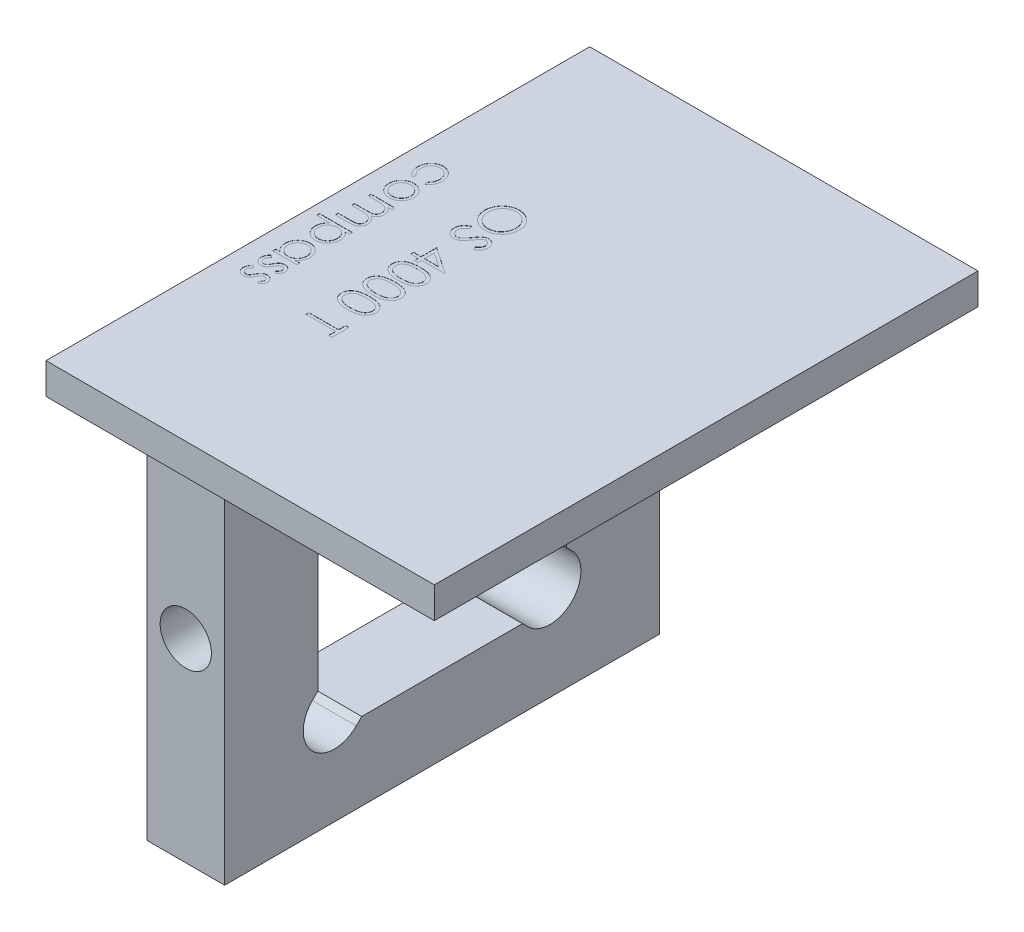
from build123d import *

# Parameters (mm, degrees)
ESQUISSE1_W             = 25
ESQUISSE1_H             = 2
BOSS_EXTRU_1_DEPTH      = 17.5
BOSS_EXTRU_3_START      = -3
ESQUISSE4_W             = 28
ESQUISSE4_H             = 25
ESQUISSE4_W_2           = 16
ESQUISSE4_H_2           = 16
BOSS_EXTRU_3_DEPTH      = 5
ENL_V_MAT_EXTRU_2_DEPTH = 0.01
TROU_TARAUD_M41_D       = 3.3
ENL_V_MAT_EXTRU_3_DEPTH = 10


with BuildPart() as part:
    # Esquisse1 → Boss.-Extru.1 (new, symmetric)
    with BuildSketch(Plane.XY):
        with Locations((12.5, 1)):
            Rectangle(ESQUISSE1_W, ESQUISSE1_H)
    extrude(amount=BOSS_EXTRU_1_DEPTH, both=True)

    # Esquisse4 → Boss.-Extru.3 (add)
    with BuildSketch(Plane.ZY.offset(BOSS_EXTRU_3_START)):
        with Locations((0, -12.5)):
            Rectangle(ESQUISSE4_W, ESQUISSE4_H)
        with Locations((0, -12)):
            Rectangle(ESQUISSE4_W_2, ESQUISSE4_H_2, mode=Mode.SUBTRACT)
    extrude(amount=-BOSS_EXTRU_3_DEPTH)

    # Esquisse7 → Enl_v. mat.-Extru.2 (cut)
    # profile 1 of 14: a face of its own
    with BuildSketch(Plane(origin=(0, 2, 0), x_dir=(1, 0, 0), z_dir=(0, 1, 0))):
        with BuildLine():
            add(Edge.make_bspline(
                [(7.961185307, 5.02613987), (7.960192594, 4.986946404), (7.958242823, 4.909967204), (7.94331797, 4.79683132), (7.917496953, 4.688824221), (7.883110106, 4.585063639), (7.837229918, 4.486799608), (7.781806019, 4.393259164), (7.716050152, 4.30470678), (7.64106567, 4.221954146), (7.559182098, 4.146505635), (7.471545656, 4.080586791), (7.37935639, 4.024852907), (7.282293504, 3.979171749), (7.180784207, 3.943302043), (7.074251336, 3.918557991), (6.963394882, 3.902750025), (6.887783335, 3.900902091), (6.849426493, 3.899964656)],
                knots=[0, 0, 0, 0, 1.06508495, 2.091914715, 3.094501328, 4.079693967, 5.057647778, 6.035986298, 7.030177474, 8.050107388, 9.066943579, 10.051896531, 11.025616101, 11.9896488, 12.96281505, 13.945825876, 14.957941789, 16, 16, 16, 16], degree=3))
            add(Edge.make_bspline(
                [(6.849426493, 3.899964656), (6.811352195, 3.900901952), (6.736303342, 3.902749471), (6.626150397, 3.918575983), (6.520260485, 3.943393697), (6.418820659, 3.978839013), (6.321685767, 4.024300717), (6.229327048, 4.080411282), (6.141083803, 4.1458937), (6.058802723, 4.22108143), (5.983205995, 4.302945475), (5.917184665, 4.390829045), (5.860764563, 4.482927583), (5.815396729, 4.579931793), (5.779273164, 4.680760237), (5.754620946, 4.786337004), (5.738725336, 4.896191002), (5.736899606, 4.971103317), (5.735971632, 5.0091794)],
                knots=[0, 0, 0, 0, 1.04355943, 2.056976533, 3.044937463, 4.02179873, 4.997890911, 5.980248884, 6.980147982, 8.006253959, 9.032111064, 10.031228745, 11.015595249, 11.988180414, 12.962670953, 13.946861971, 14.95644057, 16, 16, 16, 16], degree=3))
            add(Edge.make_bspline(
                [(5.735971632, 5.0091794), (5.736908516, 5.047536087), (5.738755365, 5.123147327), (5.754590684, 5.234142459), (5.779343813, 5.340752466), (5.814752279, 5.4426491), (5.860341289, 5.539865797), (5.916363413, 5.632393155), (5.982377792, 5.720342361), (6.057465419, 5.80281843), (6.139368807, 5.878190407), (6.226674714, 5.944484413), (6.31855281, 6.000183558), (6.414624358, 6.045791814), (6.514641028, 6.081866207), (6.619231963, 6.106485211), (6.727811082, 6.122411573), (6.801738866, 6.124247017), (6.839250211, 6.125178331)],
                knots=[0, 0, 0, 0, 1.053167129, 2.076072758, 3.073341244, 4.055601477, 5.033424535, 6.017524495, 7.021518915, 8.049444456, 9.077120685, 10.074910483, 11.055688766, 12.022980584, 12.991883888, 13.970269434, 14.970104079, 16, 16, 16, 16], degree=3))
            add(Edge.make_bspline(
                [(6.839250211, 6.125178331), (6.864428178, 6.124855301), (6.914466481, 6.124213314), (6.988769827, 6.116473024), (7.061886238, 6.105263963), (7.13356993, 6.089115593), (7.20383261, 6.068285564), (7.272530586, 6.042616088), (7.340229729, 6.013198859), (7.405641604, 5.978173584), (7.468868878, 5.93995996), (7.529120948, 5.898291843), (7.585321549, 5.852878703), (7.638373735, 5.804369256), (7.687372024, 5.752092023), (7.733384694, 5.696833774), (7.775935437, 5.638305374), (7.814130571, 5.576414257), (7.849213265, 5.512738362), (7.878504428, 5.446815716), (7.904393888, 5.380037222), (7.924968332, 5.311814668), (7.941341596, 5.242305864), (7.952466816, 5.171423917), (7.960224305, 5.099241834), (7.960863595, 5.050612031), (7.961185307, 5.02613987)],
                knots=[0, 0, 0, 0, 1.037115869, 2.061148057, 3.07517727, 4.084041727, 5.086514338, 6.092668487, 7.104487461, 8.125783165, 9.147610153, 10.147694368, 11.141876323, 12.122903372, 13.107606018, 14.091946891, 15.084523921, 16.086505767, 17.087268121, 18.077809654, 19.05670789, 20.036870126, 21.011670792, 21.99694167, 22.991993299, 24, 24, 24, 24], degree=3))
        make_face()
        with BuildLine():
            add(Edge.make_bspline(
                [(7.74409129, 5.016811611), (7.743846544, 5.036898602), (7.743359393, 5.076880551), (7.736937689, 5.136318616), (7.727794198, 5.194978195), (7.714718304, 5.252856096), (7.697066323, 5.309640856), (7.676267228, 5.365899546), (7.651800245, 5.421362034), (7.623271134, 5.475408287), (7.592106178, 5.527947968), (7.557901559, 5.577865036), (7.520823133, 5.624661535), (7.481360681, 5.66848737), (7.439112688, 5.709214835), (7.394753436, 5.747669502), (7.347005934, 5.782303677), (7.297167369, 5.814045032), (7.245302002, 5.842449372), (7.191956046, 5.867707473), (7.1366943, 5.888368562), (7.08011631, 5.905218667), (7.022311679, 5.919188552), (6.962841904, 5.928038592), (6.902005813, 5.934529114), (6.860892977, 5.93498864), (6.840098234, 5.935221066)],
                knots=[0, 0, 0, 0, 1.008585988, 2.007529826, 2.999688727, 3.990042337, 4.984966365, 5.984641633, 7.001812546, 8.027570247, 9.052811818, 10.068991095, 11.064725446, 12.050001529, 13.029093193, 14.010961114, 14.996492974, 15.989185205, 16.977398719, 17.96520407, 18.951579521, 19.937648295, 20.929603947, 21.935788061, 22.955928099, 24, 24, 24, 24], degree=3))
            add(Edge.make_bspline(
                [(6.840098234, 5.935221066), (6.809520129, 5.934450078), (6.749363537, 5.932933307), (6.661208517, 5.919654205), (6.576488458, 5.899199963), (6.495666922, 5.869048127), (6.418049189, 5.831340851), (6.344323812, 5.784757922), (6.274470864, 5.729567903), (6.208978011, 5.666876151), (6.149199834, 5.598342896), (6.09672863, 5.525570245), (6.052332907, 5.449337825), (6.016165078, 5.36944684), (5.98750557, 5.286323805), (5.967863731, 5.199433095), (5.95493667, 5.109353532), (5.953695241, 5.047951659), (5.953065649, 5.016811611)],
                knots=[0, 0, 0, 0, 1.032063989, 2.030389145, 3.003944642, 3.970395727, 4.937377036, 5.913328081, 6.909231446, 7.93887556, 8.970685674, 9.976071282, 10.964166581, 11.944589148, 12.933237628, 13.927779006, 14.949070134, 16, 16, 16, 16], degree=3))
            add(Edge.make_bspline(
                [(5.953065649, 5.016811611), (5.953353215, 4.995881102), (5.953923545, 4.954369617), (5.959667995, 4.892626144), (5.968879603, 4.831994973), (5.9821426, 4.772561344), (5.998740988, 4.714391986), (6.018463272, 4.657246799), (6.04305678, 4.6017244), (6.07027329, 4.547162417), (6.101077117, 4.494926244), (6.134803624, 4.445366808), (6.171218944, 4.398771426), (6.210338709, 4.355039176), (6.251825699, 4.314029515), (6.29674661, 4.276856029), (6.343789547, 4.241806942), (6.393744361, 4.210192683), (6.445719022, 4.181844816), (6.499267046, 4.157194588), (6.554204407, 4.136269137), (6.610624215, 4.119379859), (6.668415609, 4.106144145), (6.727656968, 4.097024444), (6.78822951, 4.090645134), (6.829198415, 4.090164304), (6.849850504, 4.089921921)],
                knots=[0, 0, 0, 0, 1.047226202, 2.076964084, 3.100341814, 4.114585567, 5.122123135, 6.126552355, 7.137064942, 8.158803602, 9.176592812, 10.169297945, 11.156925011, 12.133779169, 13.104132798, 14.073170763, 15.049307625, 16.038276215, 17.028988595, 18.010110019, 18.986169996, 19.968539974, 20.955178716, 21.950601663, 22.966915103, 24, 24, 24, 24], degree=3))
            add(Edge.make_bspline(
                [(6.849850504, 4.089921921), (6.870361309, 4.090164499), (6.911048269, 4.090645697), (6.971198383, 4.097021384), (7.030013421, 4.106153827), (7.087262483, 4.119315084), (7.142960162, 4.136278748), (7.197054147, 4.157195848), (7.249745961, 4.181861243), (7.300905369, 4.210169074), (7.349996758, 4.24198912), (7.396927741, 4.276759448), (7.440816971, 4.315080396), (7.482747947, 4.355857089), (7.521826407, 4.400108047), (7.558065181, 4.447632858), (7.592339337, 4.49785442), (7.623256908, 4.551029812), (7.65181485, 4.605906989), (7.676261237, 4.662223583), (7.697156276, 4.719440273), (7.714646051, 4.777264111), (7.727807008, 4.836102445), (7.736934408, 4.895612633), (7.74336008, 4.955896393), (7.74384678, 4.996442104), (7.74409129, 5.016811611)],
                knots=[0, 0, 0, 0, 1.029967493, 2.04313025, 3.035375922, 4.01889446, 4.991458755, 5.958017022, 6.930036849, 7.912118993, 8.892942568, 9.867138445, 10.843712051, 11.817804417, 12.803729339, 13.806387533, 14.818654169, 15.856205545, 16.894655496, 17.924916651, 18.938004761, 19.953404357, 20.957695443, 21.963967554, 22.97713031, 24, 24, 24, 24], degree=3))
        make_face(mode=Mode.SUBTRACT)
    # profile 2 of 14: a face of its own
    with BuildSketch(Plane(origin=(0, 2, 0), x_dir=(1, 0, 0), z_dir=(0, 1, 0))):
        with BuildLine():
            Line((6.198568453, 3.682870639), (6.305843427, 3.50393768))
            add(Edge.make_bspline(
                [(6.305843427, 3.50393768), (6.277985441, 3.487295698), (6.224610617, 3.455410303), (6.152487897, 3.402220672), (6.091187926, 3.347106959), (6.041067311, 3.289661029), (6.00160727, 3.230233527), (5.97366592, 3.168436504), (5.956239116, 3.104478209), (5.954122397, 3.060951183), (5.953065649, 3.039220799)],
                knots=[0, 0, 0, 0, 1.272034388, 2.437168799, 3.508375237, 4.49857839, 5.41946034, 6.295179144, 7.148887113, 8, 8, 8, 8], degree=3))
            add(Edge.make_bspline(
                [(5.953065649, 3.039220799), (5.953582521, 3.020662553), (5.954607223, 2.983870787), (5.964453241, 2.929706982), (5.979579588, 2.877103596), (6.001242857, 2.827145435), (6.027451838, 2.780519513), (6.059110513, 2.73963859), (6.094547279, 2.704274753), (6.134110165, 2.675426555), (6.176511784, 2.653031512), (6.220424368, 2.636825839), (6.265654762, 2.626511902), (6.296319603, 2.625199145), (6.311779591, 2.624537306)],
                knots=[0, 0, 0, 0, 1.095270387, 2.171376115, 3.241375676, 4.322296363, 5.380636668, 6.392615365, 7.366724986, 8.328592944, 9.273498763, 10.190095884, 11.087518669, 12, 12, 12, 12], degree=3))
            add(Edge.make_bspline(
                [(6.311779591, 2.624537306), (6.329402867, 2.625428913), (6.365228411, 2.627241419), (6.418084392, 2.642560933), (6.470391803, 2.66666024), (6.50274733, 2.688892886), (6.51954535, 2.700435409)],
                knots=[0, 0, 0, 0, 0.938893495, 1.908633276, 2.914225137, 4, 4, 4, 4], degree=3))
            add(Edge.make_bspline(
                [(6.51954535, 2.700435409), (6.531693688, 2.709885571), (6.557272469, 2.729783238), (6.594710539, 2.76446433), (6.634271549, 2.804101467), (6.675794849, 2.848892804), (6.718522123, 2.899728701), (6.763344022, 2.955565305), (6.810125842, 3.016691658), (6.841062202, 3.059770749), (6.857058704, 3.082045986)],
                knots=[0, 0, 0, 0, 0.72226686, 1.520759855, 2.393439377, 3.351307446, 4.386958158, 5.510256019, 6.712608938, 8, 8, 8, 8], degree=3))
            add(Edge.make_bspline(
                [(6.857058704, 3.082045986), (6.872924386, 3.104312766), (6.90325836, 3.146885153), (6.948220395, 3.206467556), (6.989590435, 3.259675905), (7.026792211, 3.306781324), (7.061448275, 3.346565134), (7.091701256, 3.380481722), (7.11916663, 3.407279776), (7.136969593, 3.422192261), (7.144962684, 3.428887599)],
                knots=[0, 0, 0, 0, 1.452255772, 2.776602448, 3.96446981, 5.032613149, 5.964194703, 6.766668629, 7.446264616, 8, 8, 8, 8], degree=3))
            add(Edge.make_bspline(
                [(7.144962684, 3.428887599), (7.157421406, 3.438244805), (7.181923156, 3.456647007), (7.220219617, 3.480937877), (7.259422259, 3.501583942), (7.299636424, 3.517768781), (7.340297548, 3.531397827), (7.381936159, 3.540564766), (7.424365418, 3.546304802), (7.452918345, 3.546892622), (7.467211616, 3.547186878)],
                knots=[0, 0, 0, 0, 1.068054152, 2.10047183, 3.106115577, 4.101338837, 5.06977816, 6.043150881, 7.020423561, 8, 8, 8, 8], degree=3))
            add(Edge.make_bspline(
                [(7.467211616, 3.547186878), (7.489607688, 3.546400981), (7.533921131, 3.544845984), (7.598622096, 3.531587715), (7.660582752, 3.510905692), (7.718438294, 3.480993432), (7.772053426, 3.444010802), (7.820608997, 3.400303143), (7.861775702, 3.348409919), (7.897326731, 3.291155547), (7.925395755, 3.228890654), (7.94668192, 3.163761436), (7.958582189, 3.095482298), (7.960309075, 3.049157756), (7.961185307, 3.025652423)],
                knots=[0, 0, 0, 0, 1.005541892, 1.989591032, 2.955705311, 3.932863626, 4.905387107, 5.876519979, 6.856563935, 7.871847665, 8.897921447, 9.918317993, 10.943742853, 12, 12, 12, 12], degree=3))
            add(Edge.make_bspline(
                [(7.961185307, 3.025652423), (7.960341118, 3.000705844), (7.958666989, 2.951233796), (7.943589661, 2.878326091), (7.919235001, 2.807996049), (7.89118434, 2.75138381), (7.863293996, 2.707153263), (7.837880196, 2.673424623), (7.808625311, 2.639244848), (7.77544837, 2.604339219), (7.738045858, 2.5692989), (7.696673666, 2.533603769), (7.651584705, 2.497170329), (7.619396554, 2.473732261), (7.602895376, 2.461716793)],
                knots=[0, 0, 0, 0, 1.286821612, 2.551921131, 3.825787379, 5.12137259, 5.803616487, 6.523126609, 7.299589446, 8.125436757, 9.008162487, 9.944516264, 10.946261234, 12, 12, 12, 12], degree=3))
            Line((7.602895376, 2.461716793), (7.472723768, 2.633441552))
            add(Edge.make_bspline(
                [(7.472723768, 2.633441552), (7.486082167, 2.643810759), (7.51180732, 2.663779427), (7.547833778, 2.694095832), (7.580742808, 2.722670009), (7.609326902, 2.750821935), (7.635151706, 2.777064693), (7.65726106, 2.802535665), (7.675874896, 2.826867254), (7.695729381, 2.857541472), (7.7155357, 2.896177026), (7.731938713, 2.944627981), (7.742150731, 2.995122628), (7.743437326, 3.02942), (7.74409129, 3.046853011)],
                knots=[0, 0, 0, 0, 1.181667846, 2.275615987, 3.290305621, 4.226321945, 5.078535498, 5.862783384, 6.581873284, 7.217493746, 8.414623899, 9.604724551, 10.782505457, 12, 12, 12, 12], degree=3))
            add(Edge.make_bspline(
                [(7.74409129, 3.046853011), (7.7433585, 3.068719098), (7.741945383, 3.110885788), (7.726511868, 3.170751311), (7.70221141, 3.224631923), (7.668154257, 3.270927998), (7.627803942, 3.309473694), (7.581371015, 3.337356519), (7.530097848, 3.354138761), (7.494331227, 3.356186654), (7.476115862, 3.357229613)],
                knots=[0, 0, 0, 0, 1.14458467, 2.207223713, 3.21896685, 4.227309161, 5.202851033, 6.127160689, 7.046193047, 8, 8, 8, 8], degree=3))
            add(Edge.make_bspline(
                [(7.476115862, 3.357229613), (7.464778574, 3.356980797), (7.442085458, 3.356482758), (7.408469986, 3.35000523), (7.375152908, 3.34082029), (7.341986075, 3.327377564), (7.308189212, 3.309270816), (7.273853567, 3.284651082), (7.238112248, 3.253850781), (7.214889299, 3.230210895), (7.202628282, 3.217729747)],
                knots=[0, 0, 0, 0, 0.858526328, 1.718456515, 2.587092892, 3.476767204, 4.426280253, 5.487868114, 6.673670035, 8, 8, 8, 8], degree=3))
            add(Edge.make_bspline(
                [(7.202628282, 3.217729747), (7.19849351, 3.213096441), (7.188670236, 3.202088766), (7.172588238, 3.181964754), (7.152750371, 3.155389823), (7.128204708, 3.123057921), (7.099731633, 3.084372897), (7.06769521, 3.039330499), (7.031055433, 2.98843281), (7.005439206, 2.95231527), (6.991894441, 2.933217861)],
                knots=[0, 0, 0, 0, 0.420754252, 0.999615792, 1.744751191, 2.668019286, 3.750313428, 4.999500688, 6.413464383, 8, 8, 8, 8], degree=3))
            add(Edge.make_bspline(
                [(6.991894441, 2.933217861), (6.975178, 2.910245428), (6.942808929, 2.865762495), (6.894176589, 2.802469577), (6.846613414, 2.745081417), (6.800423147, 2.693396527), (6.755956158, 2.646904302), (6.712677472, 2.606120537), (6.67089715, 2.570629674), (6.61733183, 2.532421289), (6.551545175, 2.493379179), (6.470943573, 2.459850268), (6.390028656, 2.438708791), (6.335644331, 2.435944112), (6.308811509, 2.434580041)],
                knots=[0, 0, 0, 0, 1.163667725, 2.253281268, 3.268753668, 4.215851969, 5.092017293, 5.902905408, 6.650798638, 7.335211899, 8.59617414, 9.77448103, 10.901945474, 12, 12, 12, 12], degree=3))
            add(Edge.make_bspline(
                [(6.308811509, 2.434580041), (6.289835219, 2.434977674), (6.252251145, 2.435765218), (6.197061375, 2.444809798), (6.143468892, 2.458077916), (6.092087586, 2.478012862), (6.042229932, 2.502534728), (5.99435519, 2.532822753), (5.949121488, 2.569334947), (5.905587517, 2.609916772), (5.866263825, 2.655016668), (5.831093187, 2.702570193), (5.801655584, 2.752886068), (5.777958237, 2.80572076), (5.759130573, 2.860781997), (5.745597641, 2.918127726), (5.737272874, 2.977917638), (5.736410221, 3.018558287), (5.735971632, 3.039220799)],
                knots=[0, 0, 0, 0, 0.983610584, 1.948120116, 2.894308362, 3.843560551, 4.801159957, 5.773581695, 6.77566113, 7.813174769, 8.857584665, 9.875476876, 10.877851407, 11.875574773, 12.875048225, 13.892438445, 14.928473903, 16, 16, 16, 16], degree=3))
            add(Edge.make_bspline(
                [(5.735971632, 3.039220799), (5.736284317, 3.055207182), (5.73690575, 3.086978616), (5.742269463, 3.133846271), (5.750135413, 3.179853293), (5.762128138, 3.22442201), (5.777021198, 3.268107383), (5.795255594, 3.310520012), (5.816962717, 3.351762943), (5.842178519, 3.391884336), (5.871238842, 3.431262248), (5.90482228, 3.469694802), (5.942696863, 3.507621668), (5.985251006, 3.544347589), (6.03203006, 3.58054952), (6.083425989, 3.61555422), (6.139171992, 3.650074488), (6.178399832, 3.671734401), (6.198568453, 3.682870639)],
                knots=[0, 0, 0, 0, 0.915384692, 1.819241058, 2.699029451, 3.586605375, 4.459625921, 5.340865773, 6.228072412, 7.126546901, 8.052715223, 9.028303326, 10.047266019, 11.120332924, 12.245748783, 13.433636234, 14.680528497, 16, 16, 16, 16], degree=3))
        make_face()
    # profile 3 of 14: a face of its own
    with BuildSketch(Plane(origin=(0, 2, 0), x_dir=(1, 0, 0), z_dir=(0, 1, 0))):
        Polygon((7.961185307, 0.220814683), (7.961185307, 0.182229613), (6.495800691, 0.182229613), (6.495800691, -0.062001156), (6.278706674, -0.062001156), (6.278706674, 0.182229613), (5.790245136, 0.182229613), (5.790245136, 0.372186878), (6.278706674, 0.372186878), (6.278706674, 1.376246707), align=None)
        Polygon((6.495800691, 0.372186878), (7.41505817, 0.372186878), (6.495800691, 1.003116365), align=None, mode=Mode.SUBTRACT)
    # profile 4 of 14: a face of its own
    with BuildSketch(Plane(origin=(0, 2, 0), x_dir=(1, 0, 0), z_dir=(0, 1, 0))):
        with BuildLine():
            add(Edge.make_bspline(
                [(6.847730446, -0.251958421), (6.881656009, -0.252156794), (6.947556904, -0.252542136), (7.043583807, -0.256828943), (7.133669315, -0.263950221), (7.217817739, -0.273709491), (7.296050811, -0.285585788), (7.368159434, -0.301439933), (7.43447744, -0.319469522), (7.495220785, -0.340365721), (7.551208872, -0.363943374), (7.603473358, -0.389608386), (7.651947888, -0.418365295), (7.697360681, -0.448619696), (7.739204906, -0.481477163), (7.777401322, -0.516591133), (7.811972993, -0.554309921), (7.843331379, -0.593887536), (7.870648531, -0.635574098), (7.8952631, -0.678084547), (7.915465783, -0.722169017), (7.932065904, -0.767425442), (7.945367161, -0.813722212), (7.954578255, -0.861250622), (7.960351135, -0.910022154), (7.960904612, -0.942939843), (7.961185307, -0.959634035)],
                knots=[0, 0, 0, 0, 1.646377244, 3.198111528, 4.663803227, 6.031090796, 7.308794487, 8.502186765, 9.612154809, 10.642545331, 11.617106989, 12.558866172, 13.465886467, 14.35053239, 15.20542558, 16.045215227, 16.865619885, 17.686225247, 18.492864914, 19.282407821, 20.068097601, 20.842842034, 21.620163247, 22.403093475, 23.190129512, 24, 24, 24, 24], degree=3))
            add(Edge.make_bspline(
                [(7.961185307, -0.959634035), (7.960890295, -0.976467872), (7.960303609, -1.009945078), (7.954664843, -1.059439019), (7.945308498, -1.107789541), (7.932051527, -1.15479051), (7.915604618, -1.200828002), (7.894990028, -1.245541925), (7.870993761, -1.289210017), (7.842797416, -1.331138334), (7.811360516, -1.371787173), (7.775823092, -1.410158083), (7.736543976, -1.446254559), (7.69394342, -1.480529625), (7.647204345, -1.512010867), (7.597139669, -1.54199099), (7.542873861, -1.568825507), (7.48531234, -1.594669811), (7.422862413, -1.616977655), (7.355876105, -1.637095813), (7.283562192, -1.653351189), (7.206300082, -1.666891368), (7.123806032, -1.677380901), (7.03625688, -1.685020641), (6.943595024, -1.689056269), (6.880241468, -1.689816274), (6.847730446, -1.690206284)],
                knots=[0, 0, 0, 0, 0.810914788, 1.612654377, 2.396697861, 3.181598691, 3.963628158, 4.749916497, 5.551656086, 6.361998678, 7.18212741, 8.025565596, 8.878627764, 9.750805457, 10.657531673, 11.591944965, 12.560506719, 13.57287815, 14.630710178, 15.753379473, 16.941251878, 18.199788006, 19.531962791, 20.947069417, 22.433333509, 24, 24, 24, 24], degree=3))
            add(Edge.make_bspline(
                [(6.847730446, -1.690206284), (6.815361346, -1.689811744), (6.752291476, -1.689042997), (6.660044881, -1.685071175), (6.572966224, -1.677210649), (6.490813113, -1.667488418), (6.414073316, -1.653639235), (6.342017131, -1.637895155), (6.275266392, -1.618326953), (6.21314582, -1.596323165), (6.155866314, -1.571039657), (6.102069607, -1.543967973), (6.052045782, -1.514171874), (6.005307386, -1.482502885), (5.962337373, -1.448519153), (5.923029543, -1.41226983), (5.887409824, -1.373727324), (5.855543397, -1.332986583), (5.827675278, -1.290398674), (5.802765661, -1.246876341), (5.782553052, -1.201550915), (5.765487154, -1.155429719), (5.752199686, -1.108077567), (5.743101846, -1.059540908), (5.736703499, -1.009978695), (5.736216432, -0.976473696), (5.735971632, -0.959634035)],
                knots=[0, 0, 0, 0, 1.56130642, 3.042141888, 4.451772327, 5.777565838, 7.030558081, 8.211376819, 9.333164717, 10.383253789, 11.387583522, 12.350962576, 13.286244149, 14.193812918, 15.072134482, 15.925989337, 16.770211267, 17.600669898, 18.417446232, 19.22325363, 20.01647746, 20.807971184, 21.593601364, 22.38506573, 23.188331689, 24, 24, 24, 24], degree=3))
            add(Edge.make_bspline(
                [(5.735971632, -0.959634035), (5.736255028, -0.942940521), (5.73681383, -0.91002417), (5.742547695, -0.861242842), (5.751897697, -0.813788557), (5.764594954, -0.767566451), (5.780732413, -0.72248193), (5.801258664, -0.678976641), (5.825065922, -0.636476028), (5.852151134, -0.595174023), (5.88319008, -0.555857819), (5.917518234, -0.518302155), (5.955996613, -0.483455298), (5.998009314, -0.451009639), (6.043199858, -0.42022047), (6.092013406, -0.391745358), (6.144767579, -0.366130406), (6.201064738, -0.342024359), (6.262254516, -0.320774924), (6.328926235, -0.302146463), (6.401448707, -0.286617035), (6.479606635, -0.274128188), (6.563458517, -0.263832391), (6.65315199, -0.256862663), (6.748609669, -0.252538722), (6.814087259, -0.252155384), (6.847730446, -0.251958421)],
                knots=[0, 0, 0, 0, 0.810940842, 1.599017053, 2.38298203, 3.159479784, 3.926441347, 4.70693857, 5.494146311, 6.292334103, 7.104379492, 7.925868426, 8.762126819, 9.623561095, 10.503686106, 11.41783325, 12.366995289, 13.351843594, 14.392337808, 15.512229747, 16.713911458, 17.994391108, 19.357476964, 20.818259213, 22.365182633, 24, 24, 24, 24], degree=3))
        make_face()
        with BuildLine():
            add(Edge.make_bspline(
                [(6.848578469, -0.441915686), (6.820306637, -0.441987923), (6.765436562, -0.442128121), (6.685702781, -0.44579068), (6.61133501, -0.450780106), (6.542238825, -0.457215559), (6.478648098, -0.466772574), (6.420125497, -0.477480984), (6.366980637, -0.490512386), (6.318849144, -0.505931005), (6.274913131, -0.52349205), (6.23403267, -0.542668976), (6.195712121, -0.563259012), (6.160340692, -0.586342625), (6.127566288, -0.61139623), (6.097483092, -0.638460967), (6.070222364, -0.667489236), (6.037874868, -0.707673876), (6.004052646, -0.760463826), (5.974962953, -0.827318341), (5.956563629, -0.896044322), (5.95423029, -0.942704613), (5.953065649, -0.965994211)],
                knots=[0, 0, 0, 0, 1.459116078, 2.831857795, 4.118796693, 5.306371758, 6.412361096, 7.436813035, 8.376339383, 9.234574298, 10.043323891, 10.816788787, 11.564361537, 12.286735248, 12.994408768, 13.691741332, 14.372975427, 15.047457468, 16.352811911, 17.594285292, 18.799233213, 20, 20, 20, 20], degree=3))
            add(Edge.make_bspline(
                [(5.953065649, -0.965994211), (5.954031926, -0.989433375), (5.955962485, -1.036263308), (5.974588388, -1.104682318), (6.002691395, -1.171103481), (6.035921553, -1.223156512), (6.067567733, -1.262757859), (6.094548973, -1.291131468), (6.124760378, -1.317173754), (6.157356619, -1.341873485), (6.192960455, -1.364527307), (6.231400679, -1.385127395), (6.272784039, -1.40392542), (6.301673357, -1.414635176), (6.31644372, -1.420110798)],
                knots=[0, 0, 0, 0, 1.353760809, 2.704726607, 4.075137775, 5.516104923, 6.260822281, 7.007110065, 7.778089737, 8.566572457, 9.372053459, 10.217411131, 11.088608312, 12, 12, 12, 12], degree=3))
            add(Edge.make_bspline(
                [(6.31644372, -1.420110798), (6.335330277, -1.426492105), (6.373678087, -1.439448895), (6.433164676, -1.456147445), (6.495577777, -1.469298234), (6.560544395, -1.481129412), (6.628543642, -1.489204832), (6.699365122, -1.4957047), (6.773062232, -1.499533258), (6.823133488, -1.500007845), (6.848578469, -1.500249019)],
                knots=[0, 0, 0, 0, 0.884706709, 1.796334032, 2.740027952, 3.714592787, 4.726048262, 5.777819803, 6.87074269, 8, 8, 8, 8], degree=3))
            add(Edge.make_bspline(
                [(6.848578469, -1.500249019), (6.874022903, -1.49998303), (6.923803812, -1.499462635), (6.996633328, -1.496043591), (7.065926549, -1.49054947), (7.131746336, -1.483113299), (7.193975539, -1.472905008), (7.252703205, -1.460645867), (7.307913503, -1.446273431), (7.359748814, -1.429787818), (7.408022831, -1.41120876), (7.452840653, -1.390684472), (7.494439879, -1.368782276), (7.532701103, -1.344988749), (7.567797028, -1.319591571), (7.59902365, -1.291919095), (7.627348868, -1.263069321), (7.659680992, -1.222660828), (7.692647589, -1.169759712), (7.722985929, -1.10393401), (7.740408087, -1.03543224), (7.742864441, -0.989123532), (7.74409129, -0.965994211)],
                knots=[0, 0, 0, 0, 1.313668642, 2.570134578, 3.763346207, 4.902004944, 5.98888779, 7.017888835, 7.998425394, 8.933058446, 9.82474457, 10.667209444, 11.476765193, 12.250262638, 12.991704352, 13.7104269, 14.401925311, 15.076585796, 16.378385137, 17.609787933, 18.806186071, 20, 20, 20, 20], degree=3))
            add(Edge.make_bspline(
                [(7.74409129, -0.965994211), (7.742864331, -0.942582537), (7.740408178, -0.895716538), (7.723031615, -0.826517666), (7.692930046, -0.760223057), (7.659468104, -0.707746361), (7.627921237, -0.667388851), (7.600487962, -0.638890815), (7.570313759, -0.612248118), (7.537678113, -0.58717364), (7.502288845, -0.564112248), (7.463973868, -0.543513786), (7.423089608, -0.524347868), (7.379163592, -0.506749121), (7.330959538, -0.491473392), (7.278082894, -0.477819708), (7.21950563, -0.467117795), (7.155737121, -0.457778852), (7.086555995, -0.450658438), (7.012016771, -0.445803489), (6.932145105, -0.442121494), (6.876991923, -0.441985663), (6.848578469, -0.441915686)],
                knots=[0, 0, 0, 0, 1.207964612, 2.418129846, 3.655795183, 4.951004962, 5.620895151, 6.296795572, 6.989224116, 7.696855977, 8.419187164, 9.166715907, 9.940135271, 10.748837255, 11.607021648, 12.548275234, 13.5654991, 14.678641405, 15.874140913, 17.15372626, 18.533675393, 20, 20, 20, 20], degree=3))
        make_face(mode=Mode.SUBTRACT)
    # profile 5 of 14: a face of its own
    with BuildSketch(Plane(origin=(0, 2, 0), x_dir=(1, 0, 0), z_dir=(0, 1, 0))):
        with BuildLine():
            add(Edge.make_bspline(
                [(6.847730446, -1.880163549), (6.881656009, -1.880361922), (6.947556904, -1.880747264), (7.043583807, -1.885034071), (7.133669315, -1.892155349), (7.217817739, -1.901914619), (7.296050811, -1.913790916), (7.368159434, -1.929645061), (7.43447744, -1.94767465), (7.495220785, -1.96857085), (7.551208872, -1.992148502), (7.603473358, -2.017813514), (7.651947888, -2.046570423), (7.697360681, -2.076824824), (7.739204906, -2.109682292), (7.777401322, -2.144796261), (7.811972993, -2.18251505), (7.843331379, -2.222092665), (7.870648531, -2.263779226), (7.8952631, -2.306289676), (7.915465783, -2.350374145), (7.932065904, -2.39563057), (7.945367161, -2.441927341), (7.954578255, -2.489455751), (7.960351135, -2.538227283), (7.960904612, -2.571144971), (7.961185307, -2.587839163)],
                knots=[0, 0, 0, 0, 1.646377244, 3.198111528, 4.663803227, 6.031090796, 7.308794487, 8.502186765, 9.612154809, 10.642545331, 11.617106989, 12.558866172, 13.465886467, 14.35053239, 15.20542558, 16.045215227, 16.865619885, 17.686225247, 18.492864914, 19.282407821, 20.068097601, 20.842842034, 21.620163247, 22.403093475, 23.190129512, 24, 24, 24, 24], degree=3))
            add(Edge.make_bspline(
                [(7.961185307, -2.587839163), (7.960890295, -2.604673), (7.960303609, -2.638150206), (7.954664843, -2.687644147), (7.945308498, -2.735994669), (7.932051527, -2.782995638), (7.915604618, -2.82903313), (7.894990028, -2.873747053), (7.870993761, -2.917415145), (7.842797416, -2.959343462), (7.811360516, -2.999992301), (7.775823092, -3.038363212), (7.736543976, -3.074459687), (7.69394342, -3.108734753), (7.647204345, -3.140215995), (7.597139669, -3.170196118), (7.542873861, -3.197030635), (7.48531234, -3.222874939), (7.422862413, -3.245182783), (7.355876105, -3.265300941), (7.283562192, -3.281556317), (7.206300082, -3.295096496), (7.123806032, -3.305586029), (7.03625688, -3.313225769), (6.943595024, -3.317261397), (6.880241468, -3.318021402), (6.847730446, -3.318411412)],
                knots=[0, 0, 0, 0, 0.810914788, 1.612654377, 2.396697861, 3.181598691, 3.963628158, 4.749916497, 5.551656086, 6.361998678, 7.18212741, 8.025565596, 8.878627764, 9.750805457, 10.657531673, 11.591944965, 12.560506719, 13.57287815, 14.630710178, 15.753379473, 16.941251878, 18.199788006, 19.531962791, 20.947069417, 22.433333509, 24, 24, 24, 24], degree=3))
            add(Edge.make_bspline(
                [(6.847730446, -3.318411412), (6.815361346, -3.318016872), (6.752291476, -3.317248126), (6.660044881, -3.313276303), (6.572966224, -3.305415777), (6.490813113, -3.295693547), (6.414073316, -3.281844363), (6.342017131, -3.266100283), (6.275266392, -3.246532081), (6.21314582, -3.224528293), (6.155866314, -3.199244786), (6.102069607, -3.172173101), (6.052045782, -3.142377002), (6.005307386, -3.110708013), (5.962337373, -3.076724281), (5.923029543, -3.040474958), (5.887409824, -3.001932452), (5.855543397, -2.961191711), (5.827675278, -2.918603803), (5.802765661, -2.875081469), (5.782553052, -2.829756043), (5.765487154, -2.783634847), (5.752199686, -2.736282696), (5.743101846, -2.687746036), (5.736703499, -2.638183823), (5.736216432, -2.604678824), (5.735971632, -2.587839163)],
                knots=[0, 0, 0, 0, 1.56130642, 3.042141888, 4.451772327, 5.777565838, 7.030558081, 8.211376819, 9.333164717, 10.383253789, 11.387583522, 12.350962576, 13.286244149, 14.193812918, 15.072134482, 15.925989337, 16.770211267, 17.600669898, 18.417446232, 19.22325363, 20.01647746, 20.807971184, 21.593601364, 22.38506573, 23.188331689, 24, 24, 24, 24], degree=3))
            add(Edge.make_bspline(
                [(5.735971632, -2.587839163), (5.736255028, -2.571145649), (5.73681383, -2.538229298), (5.742547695, -2.48944797), (5.751897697, -2.441993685), (5.764594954, -2.39577158), (5.780732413, -2.350687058), (5.801258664, -2.307181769), (5.825065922, -2.264681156), (5.852151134, -2.223379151), (5.88319008, -2.184062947), (5.917518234, -2.146507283), (5.955996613, -2.111660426), (5.998009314, -2.079214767), (6.043199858, -2.048425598), (6.092013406, -2.019950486), (6.144767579, -1.994335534), (6.201064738, -1.970229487), (6.262254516, -1.948980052), (6.328926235, -1.930351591), (6.401448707, -1.914822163), (6.479606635, -1.902333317), (6.563458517, -1.892037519), (6.65315199, -1.885067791), (6.748609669, -1.88074385), (6.814087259, -1.880360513), (6.847730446, -1.880163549)],
                knots=[0, 0, 0, 0, 0.810940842, 1.599017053, 2.38298203, 3.159479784, 3.926441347, 4.70693857, 5.494146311, 6.292334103, 7.104379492, 7.925868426, 8.762126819, 9.623561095, 10.503686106, 11.41783325, 12.366995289, 13.351843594, 14.392337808, 15.512229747, 16.713911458, 17.994391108, 19.357476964, 20.818259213, 22.365182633, 24, 24, 24, 24], degree=3))
        make_face()
        with BuildLine():
            add(Edge.make_bspline(
                [(6.848578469, -2.070120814), (6.820306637, -2.070193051), (6.765436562, -2.070333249), (6.685702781, -2.073995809), (6.61133501, -2.078985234), (6.542238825, -2.085420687), (6.478648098, -2.094977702), (6.420125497, -2.105686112), (6.366980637, -2.118717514), (6.318849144, -2.134136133), (6.274913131, -2.151697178), (6.23403267, -2.170874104), (6.195712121, -2.19146414), (6.160340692, -2.214547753), (6.127566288, -2.239601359), (6.097483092, -2.266666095), (6.070222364, -2.295694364), (6.037874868, -2.335879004), (6.004052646, -2.388668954), (5.974962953, -2.455523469), (5.956563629, -2.52424945), (5.95423029, -2.570909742), (5.953065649, -2.59419934)],
                knots=[0, 0, 0, 0, 1.459116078, 2.831857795, 4.118796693, 5.306371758, 6.412361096, 7.436813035, 8.376339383, 9.234574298, 10.043323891, 10.816788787, 11.564361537, 12.286735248, 12.994408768, 13.691741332, 14.372975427, 15.047457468, 16.352811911, 17.594285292, 18.799233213, 20, 20, 20, 20], degree=3))
            add(Edge.make_bspline(
                [(5.953065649, -2.59419934), (5.954031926, -2.617638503), (5.955962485, -2.664468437), (5.974588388, -2.732887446), (6.002691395, -2.799308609), (6.035921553, -2.85136164), (6.067567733, -2.890962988), (6.094548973, -2.919336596), (6.124760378, -2.945378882), (6.157356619, -2.970078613), (6.192960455, -2.992732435), (6.231400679, -3.013332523), (6.272784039, -3.032130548), (6.301673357, -3.042840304), (6.31644372, -3.048315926)],
                knots=[0, 0, 0, 0, 1.353760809, 2.704726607, 4.075137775, 5.516104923, 6.260822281, 7.007110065, 7.778089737, 8.566572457, 9.372053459, 10.217411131, 11.088608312, 12, 12, 12, 12], degree=3))
            add(Edge.make_bspline(
                [(6.31644372, -3.048315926), (6.335330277, -3.054697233), (6.373678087, -3.067654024), (6.433164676, -3.084352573), (6.495577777, -3.097503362), (6.560544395, -3.10933454), (6.628543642, -3.11740996), (6.699365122, -3.123909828), (6.773062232, -3.127738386), (6.823133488, -3.128212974), (6.848578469, -3.128454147)],
                knots=[0, 0, 0, 0, 0.884706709, 1.796334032, 2.740027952, 3.714592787, 4.726048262, 5.777819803, 6.87074269, 8, 8, 8, 8], degree=3))
            add(Edge.make_bspline(
                [(6.848578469, -3.128454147), (6.874022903, -3.128188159), (6.923803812, -3.127667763), (6.996633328, -3.124248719), (7.065926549, -3.118754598), (7.131746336, -3.111318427), (7.193975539, -3.101110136), (7.252703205, -3.088850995), (7.307913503, -3.074478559), (7.359748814, -3.057992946), (7.408022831, -3.039413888), (7.452840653, -3.0188896), (7.494439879, -2.996987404), (7.532701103, -2.973193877), (7.567797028, -2.947796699), (7.59902365, -2.920124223), (7.627348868, -2.891274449), (7.659680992, -2.850865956), (7.692647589, -2.79796484), (7.722985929, -2.732139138), (7.740408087, -2.663637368), (7.742864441, -2.61732866), (7.74409129, -2.59419934)],
                knots=[0, 0, 0, 0, 1.313668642, 2.570134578, 3.763346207, 4.902004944, 5.98888779, 7.017888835, 7.998425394, 8.933058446, 9.82474457, 10.667209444, 11.476765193, 12.250262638, 12.991704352, 13.7104269, 14.401925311, 15.076585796, 16.378385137, 17.609787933, 18.806186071, 20, 20, 20, 20], degree=3))
            add(Edge.make_bspline(
                [(7.74409129, -2.59419934), (7.742864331, -2.570787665), (7.740408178, -2.523921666), (7.723031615, -2.454722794), (7.692930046, -2.388428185), (7.659468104, -2.335951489), (7.627921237, -2.29559398), (7.600487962, -2.267095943), (7.570313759, -2.240453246), (7.537678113, -2.215378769), (7.502288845, -2.192317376), (7.463973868, -2.171718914), (7.423089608, -2.152552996), (7.379163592, -2.134954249), (7.330959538, -2.11967852), (7.278082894, -2.106024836), (7.21950563, -2.095322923), (7.155737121, -2.085983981), (7.086555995, -2.078863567), (7.012016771, -2.074008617), (6.932145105, -2.070326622), (6.876991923, -2.070190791), (6.848578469, -2.070120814)],
                knots=[0, 0, 0, 0, 1.207964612, 2.418129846, 3.655795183, 4.951004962, 5.620895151, 6.296795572, 6.989224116, 7.696855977, 8.419187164, 9.166715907, 9.940135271, 10.748837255, 11.607021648, 12.548275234, 13.5654991, 14.678641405, 15.874140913, 17.15372626, 18.533675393, 20, 20, 20, 20], degree=3))
        make_face(mode=Mode.SUBTRACT)
    # profile 6 of 14: a face of its own
    with BuildSketch(Plane(origin=(0, 2, 0), x_dir=(1, 0, 0), z_dir=(0, 1, 0))):
        with BuildLine():
            add(Edge.make_bspline(
                [(6.847730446, -3.508368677), (6.881656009, -3.50856705), (6.947556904, -3.508952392), (7.043583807, -3.513239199), (7.133669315, -3.520360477), (7.217817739, -3.530119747), (7.296050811, -3.541996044), (7.368159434, -3.55785019), (7.43447744, -3.575879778), (7.495220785, -3.596775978), (7.551208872, -3.62035363), (7.603473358, -3.646018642), (7.651947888, -3.674775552), (7.697360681, -3.705029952), (7.739204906, -3.73788742), (7.777401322, -3.77300139), (7.811972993, -3.810720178), (7.843331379, -3.850297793), (7.870648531, -3.891984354), (7.8952631, -3.934494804), (7.915465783, -3.978579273), (7.932065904, -4.023835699), (7.945367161, -4.070132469), (7.954578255, -4.117660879), (7.960351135, -4.166432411), (7.960904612, -4.199350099), (7.961185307, -4.216044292)],
                knots=[0, 0, 0, 0, 1.646377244, 3.198111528, 4.663803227, 6.031090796, 7.308794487, 8.502186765, 9.612154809, 10.642545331, 11.617106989, 12.558866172, 13.465886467, 14.35053239, 15.20542558, 16.045215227, 16.865619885, 17.686225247, 18.492864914, 19.282407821, 20.068097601, 20.842842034, 21.620163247, 22.403093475, 23.190129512, 24, 24, 24, 24], degree=3))
            add(Edge.make_bspline(
                [(7.961185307, -4.216044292), (7.960890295, -4.232878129), (7.960303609, -4.266355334), (7.954664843, -4.315849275), (7.945308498, -4.364199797), (7.932051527, -4.411200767), (7.915604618, -4.457238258), (7.894990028, -4.501952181), (7.870993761, -4.545620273), (7.842797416, -4.58754859), (7.811360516, -4.628197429), (7.775823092, -4.66656834), (7.736543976, -4.702664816), (7.69394342, -4.736939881), (7.647204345, -4.768421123), (7.597139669, -4.798401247), (7.542873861, -4.825235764), (7.48531234, -4.851080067), (7.422862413, -4.873387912), (7.355876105, -4.893506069), (7.283562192, -4.909761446), (7.206300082, -4.923301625), (7.123806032, -4.933791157), (7.03625688, -4.941430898), (6.943595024, -4.945466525), (6.880241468, -4.94622653), (6.847730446, -4.946616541)],
                knots=[0, 0, 0, 0, 0.810914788, 1.612654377, 2.396697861, 3.181598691, 3.963628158, 4.749916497, 5.551656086, 6.361998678, 7.18212741, 8.025565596, 8.878627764, 9.750805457, 10.657531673, 11.591944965, 12.560506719, 13.57287815, 14.630710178, 15.753379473, 16.941251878, 18.199788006, 19.531962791, 20.947069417, 22.433333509, 24, 24, 24, 24], degree=3))
            add(Edge.make_bspline(
                [(6.847730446, -4.946616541), (6.815361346, -4.946222), (6.752291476, -4.945453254), (6.660044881, -4.941481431), (6.572966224, -4.933620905), (6.490813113, -4.923898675), (6.414073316, -4.910049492), (6.342017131, -4.894305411), (6.275266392, -4.874737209), (6.21314582, -4.852733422), (6.155866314, -4.827449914), (6.102069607, -4.800378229), (6.052045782, -4.77058213), (6.005307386, -4.738913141), (5.962337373, -4.704929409), (5.923029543, -4.668680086), (5.887409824, -4.63013758), (5.855543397, -4.589396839), (5.827675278, -4.546808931), (5.802765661, -4.503286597), (5.782553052, -4.457961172), (5.765487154, -4.411839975), (5.752199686, -4.364487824), (5.743101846, -4.315951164), (5.736703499, -4.266388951), (5.736216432, -4.232883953), (5.735971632, -4.216044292)],
                knots=[0, 0, 0, 0, 1.56130642, 3.042141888, 4.451772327, 5.777565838, 7.030558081, 8.211376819, 9.333164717, 10.383253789, 11.387583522, 12.350962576, 13.286244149, 14.193812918, 15.072134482, 15.925989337, 16.770211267, 17.600669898, 18.417446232, 19.22325363, 20.01647746, 20.807971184, 21.593601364, 22.38506573, 23.188331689, 24, 24, 24, 24], degree=3))
            add(Edge.make_bspline(
                [(5.735971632, -4.216044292), (5.736255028, -4.199350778), (5.73681383, -4.166434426), (5.742547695, -4.117653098), (5.751897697, -4.070198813), (5.764594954, -4.023976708), (5.780732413, -3.978892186), (5.801258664, -3.935386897), (5.825065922, -3.892886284), (5.852151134, -3.85158428), (5.88319008, -3.812268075), (5.917518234, -3.774712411), (5.955996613, -3.739865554), (5.998009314, -3.707419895), (6.043199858, -3.676630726), (6.092013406, -3.648155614), (6.144767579, -3.622540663), (6.201064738, -3.598434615), (6.262254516, -3.57718518), (6.328926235, -3.558556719), (6.401448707, -3.543027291), (6.479606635, -3.530538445), (6.563458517, -3.520242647), (6.65315199, -3.51327292), (6.748609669, -3.508948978), (6.814087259, -3.508565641), (6.847730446, -3.508368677)],
                knots=[0, 0, 0, 0, 0.810940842, 1.599017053, 2.38298203, 3.159479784, 3.926441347, 4.70693857, 5.494146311, 6.292334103, 7.104379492, 7.925868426, 8.762126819, 9.623561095, 10.503686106, 11.41783325, 12.366995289, 13.351843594, 14.392337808, 15.512229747, 16.713911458, 17.994391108, 19.357476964, 20.818259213, 22.365182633, 24, 24, 24, 24], degree=3))
        make_face()
        with BuildLine():
            add(Edge.make_bspline(
                [(6.848578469, -3.698325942), (6.820306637, -3.698398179), (6.765436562, -3.698538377), (6.685702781, -3.702200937), (6.61133501, -3.707190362), (6.542238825, -3.713625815), (6.478648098, -3.723182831), (6.420125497, -3.73389124), (6.366980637, -3.746922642), (6.318849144, -3.762341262), (6.274913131, -3.779902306), (6.23403267, -3.799079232), (6.195712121, -3.819669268), (6.160340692, -3.842752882), (6.127566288, -3.867806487), (6.097483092, -3.894871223), (6.070222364, -3.923899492), (6.037874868, -3.964084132), (6.004052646, -4.016874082), (5.974962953, -4.083728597), (5.956563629, -4.152454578), (5.95423029, -4.19911487), (5.953065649, -4.222404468)],
                knots=[0, 0, 0, 0, 1.459116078, 2.831857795, 4.118796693, 5.306371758, 6.412361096, 7.436813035, 8.376339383, 9.234574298, 10.043323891, 10.816788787, 11.564361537, 12.286735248, 12.994408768, 13.691741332, 14.372975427, 15.047457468, 16.352811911, 17.594285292, 18.799233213, 20, 20, 20, 20], degree=3))
            add(Edge.make_bspline(
                [(5.953065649, -4.222404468), (5.954031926, -4.245843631), (5.955962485, -4.292673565), (5.974588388, -4.361092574), (6.002691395, -4.427513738), (6.035921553, -4.479566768), (6.067567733, -4.519168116), (6.094548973, -4.547541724), (6.124760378, -4.573584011), (6.157356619, -4.598283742), (6.192960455, -4.620937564), (6.231400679, -4.641537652), (6.272784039, -4.660335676), (6.301673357, -4.671045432), (6.31644372, -4.676521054)],
                knots=[0, 0, 0, 0, 1.353760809, 2.704726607, 4.075137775, 5.516104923, 6.260822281, 7.007110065, 7.778089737, 8.566572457, 9.372053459, 10.217411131, 11.088608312, 12, 12, 12, 12], degree=3))
            add(Edge.make_bspline(
                [(6.31644372, -4.676521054), (6.335330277, -4.682902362), (6.373678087, -4.695859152), (6.433164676, -4.712557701), (6.495577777, -4.72570849), (6.560544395, -4.737539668), (6.628543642, -4.745615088), (6.699365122, -4.752114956), (6.773062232, -4.755943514), (6.823133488, -4.756418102), (6.848578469, -4.756659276)],
                knots=[0, 0, 0, 0, 0.884706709, 1.796334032, 2.740027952, 3.714592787, 4.726048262, 5.777819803, 6.87074269, 8, 8, 8, 8], degree=3))
            add(Edge.make_bspline(
                [(6.848578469, -4.756659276), (6.874022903, -4.756393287), (6.923803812, -4.755872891), (6.996633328, -4.752453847), (7.065926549, -4.746959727), (7.131746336, -4.739523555), (7.193975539, -4.729315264), (7.252703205, -4.717056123), (7.307913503, -4.702683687), (7.359748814, -4.686198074), (7.408022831, -4.667619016), (7.452840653, -4.647094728), (7.494439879, -4.625192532), (7.532701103, -4.601399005), (7.567797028, -4.576001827), (7.59902365, -4.548329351), (7.627348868, -4.519479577), (7.659680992, -4.479071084), (7.692647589, -4.426169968), (7.722985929, -4.360344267), (7.740408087, -4.291842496), (7.742864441, -4.245533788), (7.74409129, -4.222404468)],
                knots=[0, 0, 0, 0, 1.313668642, 2.570134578, 3.763346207, 4.902004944, 5.98888779, 7.017888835, 7.998425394, 8.933058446, 9.82474457, 10.667209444, 11.476765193, 12.250262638, 12.991704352, 13.7104269, 14.401925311, 15.076585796, 16.378385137, 17.609787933, 18.806186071, 20, 20, 20, 20], degree=3))
            add(Edge.make_bspline(
                [(7.74409129, -4.222404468), (7.742864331, -4.198992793), (7.740408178, -4.152126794), (7.723031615, -4.082927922), (7.692930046, -4.016633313), (7.659468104, -3.964156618), (7.627921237, -3.923799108), (7.600487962, -3.895301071), (7.570313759, -3.868658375), (7.537678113, -3.843583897), (7.502288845, -3.820522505), (7.463973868, -3.799924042), (7.423089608, -3.780758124), (7.379163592, -3.763159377), (7.330959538, -3.747883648), (7.278082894, -3.734229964), (7.21950563, -3.723528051), (7.155737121, -3.714189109), (7.086555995, -3.707068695), (7.012016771, -3.702213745), (6.932145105, -3.69853175), (6.876991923, -3.698395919), (6.848578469, -3.698325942)],
                knots=[0, 0, 0, 0, 1.207964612, 2.418129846, 3.655795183, 4.951004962, 5.620895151, 6.296795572, 6.989224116, 7.696855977, 8.419187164, 9.166715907, 9.940135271, 10.748837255, 11.607021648, 12.548275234, 13.5654991, 14.678641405, 15.874140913, 17.15372626, 18.533675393, 20, 20, 20, 20], degree=3))
        make_face(mode=Mode.SUBTRACT)
    # profile 7 of 14: a face of its own
    with BuildSketch(Plane(origin=(0, 2, 0), x_dir=(1, 0, 0), z_dir=(0, 1, 0))):
        Polygon((7.689817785, -5.896402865), (7.906911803, -5.896402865), (7.906911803, -7.009009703), (7.689817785, -7.009009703), (7.689817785, -6.547684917), (5.790245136, -6.547684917), (5.790245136, -6.357727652), (7.689817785, -6.357727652), align=None)
    # profile 8 of 14: a face of its own
    with BuildSketch(Plane(origin=(0, 2, 0), x_dir=(1, 0, 0), z_dir=(0, 1, 0))):
        with BuildLine():
            Line((2.392458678, 4.551246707), (2.293663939, 4.710251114))
            add(Edge.make_bspline(
                [(2.293663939, 4.710251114), (2.315333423, 4.727685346), (2.357986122, 4.76200167), (2.412999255, 4.821608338), (2.460441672, 4.885163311), (2.498587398, 4.953864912), (2.52869952, 5.027111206), (2.549627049, 5.105053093), (2.562781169, 5.187666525), (2.564269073, 5.244313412), (2.565031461, 5.273338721)],
                knots=[0, 0, 0, 0, 1.026629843, 2.020746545, 2.988156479, 3.951609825, 4.916760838, 5.907688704, 6.927920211, 8, 8, 8, 8], degree=3))
            add(Edge.make_bspline(
                [(2.565031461, 5.273338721), (2.564392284, 5.29653673), (2.563133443, 5.342224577), (2.555265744, 5.409296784), (2.540965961, 5.473183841), (2.52213426, 5.534294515), (2.496858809, 5.592163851), (2.466286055, 5.646953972), (2.430285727, 5.698848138), (2.389117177, 5.747021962), (2.343899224, 5.790925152), (2.296147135, 5.829753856), (2.245526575, 5.862161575), (2.192998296, 5.889175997), (2.137658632, 5.909501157), (2.080179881, 5.924447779), (2.020183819, 5.933558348), (1.979361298, 5.934662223), (1.958694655, 5.935221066)],
                knots=[0, 0, 0, 0, 1.11253269, 2.191102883, 3.232049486, 4.248096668, 5.252846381, 6.25411548, 7.252444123, 8.276484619, 9.287796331, 10.271127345, 11.222403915, 12.165070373, 13.097940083, 14.043161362, 15.009338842, 16, 16, 16, 16], degree=3))
            add(Edge.make_bspline(
                [(1.958694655, 5.935221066), (1.931618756, 5.934147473), (1.877831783, 5.932014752), (1.798457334, 5.915225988), (1.7215699, 5.887920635), (1.648197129, 5.849815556), (1.580167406, 5.802407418), (1.518655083, 5.747088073), (1.466221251, 5.682630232), (1.422338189, 5.610925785), (1.386918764, 5.533269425), (1.361925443, 5.450276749), (1.34675525, 5.362654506), (1.344849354, 5.302656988), (1.343877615, 5.272066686)],
                knots=[0, 0, 0, 0, 0.966447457, 1.919872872, 2.884287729, 3.873230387, 4.863319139, 5.838939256, 6.818209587, 7.819967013, 8.834377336, 9.85802846, 10.90789553, 12, 12, 12, 12], degree=3))
            add(Edge.make_bspline(
                [(1.343877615, 5.272066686), (1.344663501, 5.244032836), (1.346207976, 5.188938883), (1.359227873, 5.108404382), (1.38054188, 5.031732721), (1.410264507, 4.958926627), (1.448683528, 4.890119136), (1.496072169, 4.825754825), (1.551067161, 4.764552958), (1.593592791, 4.728571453), (1.615245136, 4.710251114)],
                knots=[0, 0, 0, 0, 1.039848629, 2.043578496, 3.018386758, 3.987534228, 4.954977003, 5.934852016, 6.948509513, 8, 8, 8, 8], degree=3))
            Line((1.615245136, 4.710251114), (1.510938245, 4.551246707))
            add(Edge.make_bspline(
                [(1.510938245, 4.551246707), (1.497094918, 4.560673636), (1.469454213, 4.579496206), (1.430479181, 4.610959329), (1.394005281, 4.644903), (1.360043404, 4.681167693), (1.327997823, 4.719293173), (1.298776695, 4.760271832), (1.271640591, 4.803406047), (1.247049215, 4.848893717), (1.224992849, 4.896286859), (1.205905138, 4.94558692), (1.189766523, 4.996571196), (1.176707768, 5.04912512), (1.166376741, 5.103331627), (1.159505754, 5.159149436), (1.154381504, 5.216568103), (1.1540754, 5.25537692), (1.15392035, 5.275034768)],
                knots=[0, 0, 0, 0, 0.954067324, 1.904967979, 2.850944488, 3.791040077, 4.734579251, 5.686741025, 6.656553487, 7.63677735, 8.631289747, 9.633371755, 10.647134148, 11.676547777, 12.717490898, 13.789379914, 14.88025357, 16, 16, 16, 16], degree=3))
            add(Edge.make_bspline(
                [(1.15392035, 5.275034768), (1.154459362, 5.305037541), (1.155515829, 5.363843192), (1.167132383, 5.449914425), (1.184644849, 5.532170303), (1.209781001, 5.610582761), (1.24213869, 5.685163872), (1.281663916, 5.755844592), (1.328685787, 5.822389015), (1.382364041, 5.884146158), (1.440574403, 5.940845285), (1.503351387, 5.989602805), (1.568600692, 6.03166693), (1.637082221, 6.066356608), (1.709055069, 6.092561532), (1.783955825, 6.111211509), (1.861782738, 6.123085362), (1.914837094, 6.124474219), (1.941734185, 6.125178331)],
                knots=[0, 0, 0, 0, 1.112900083, 2.181292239, 3.217426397, 4.231060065, 5.231907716, 6.230057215, 7.231385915, 8.250448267, 9.26326716, 10.242335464, 11.195469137, 12.140906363, 13.085222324, 14.031808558, 15.002181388, 16, 16, 16, 16], degree=3))
            add(Edge.make_bspline(
                [(1.941734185, 6.125178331), (1.959982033, 6.124895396), (1.996280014, 6.12433259), (2.050227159, 6.118484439), (2.103218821, 6.109725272), (2.155178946, 6.097290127), (2.206264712, 6.08168605), (2.256203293, 6.062074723), (2.305285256, 6.039123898), (2.352906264, 6.012422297), (2.398777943, 5.982968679), (2.44263912, 5.950962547), (2.483366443, 5.915853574), (2.521979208, 5.8783845), (2.557324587, 5.837987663), (2.590929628, 5.795415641), (2.621053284, 5.749617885), (2.649182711, 5.701761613), (2.674185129, 5.651784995), (2.695737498, 5.600039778), (2.714153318, 5.546824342), (2.728733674, 5.492057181), (2.740960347, 5.436100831), (2.748651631, 5.378514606), (2.754086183, 5.319518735), (2.754685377, 5.279570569), (2.754988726, 5.259346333)],
                knots=[0, 0, 0, 0, 0.991083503, 1.971428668, 2.944771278, 3.907728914, 4.872032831, 5.84458753, 6.820199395, 7.813689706, 8.808455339, 9.780676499, 10.761021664, 11.727616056, 12.70141294, 13.675300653, 14.672050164, 15.67696011, 16.690052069, 17.705469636, 18.720567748, 19.746988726, 20.783187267, 21.830086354, 22.901455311, 24, 24, 24, 24], degree=3))
            add(Edge.make_bspline(
                [(2.754988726, 5.259346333), (2.754431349, 5.234018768), (2.753319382, 5.183490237), (2.743956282, 5.108536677), (2.729851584, 5.034682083), (2.708912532, 4.963245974), (2.683750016, 4.895128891), (2.654948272, 4.831490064), (2.622313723, 4.773327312), (2.586035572, 4.720100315), (2.545322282, 4.67159775), (2.499470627, 4.627299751), (2.448757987, 4.586276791), (2.411379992, 4.563019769), (2.392458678, 4.551246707)],
                knots=[0, 0, 0, 0, 1.095247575, 2.185020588, 3.262981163, 4.344680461, 5.40090428, 6.402280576, 7.363136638, 8.282296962, 9.184898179, 10.097200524, 11.036773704, 12, 12, 12, 12], degree=3))
        make_face()
    # profile 9 of 14: a face of its own
    with BuildSketch(Plane(origin=(0, 2, 0), x_dir=(1, 0, 0), z_dir=(0, 1, 0))):
        with BuildLine():
            add(Edge.make_bspline(
                [(2.754988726, 3.42422347), (2.754372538, 3.395199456), (2.753164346, 3.338290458), (2.740187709, 3.2549597), (2.720509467, 3.17549778), (2.692809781, 3.099563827), (2.656466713, 3.027785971), (2.612517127, 2.959523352), (2.560663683, 2.894912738), (2.520529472, 2.856195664), (2.500157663, 2.836543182)],
                knots=[0, 0, 0, 0, 1.054042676, 2.066720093, 3.05716247, 4.025731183, 4.997454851, 5.974904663, 6.97207755, 8, 8, 8, 8], degree=3))
            add(Edge.make_bspline(
                [(2.500157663, 2.836543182), (2.480675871, 2.819620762), (2.442089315, 2.786103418), (2.379523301, 2.743125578), (2.31472905, 2.706101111), (2.246846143, 2.676429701), (2.176467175, 2.653034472), (2.103350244, 2.636424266), (2.027656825, 2.62654431), (1.976249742, 2.625212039), (1.95021442, 2.624537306)],
                knots=[0, 0, 0, 0, 1.025258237, 2.030674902, 3.01204498, 3.988269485, 4.97094183, 5.956517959, 6.965070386, 8, 8, 8, 8], degree=3))
            add(Edge.make_bspline(
                [(1.95021442, 2.624537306), (1.924028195, 2.625130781), (1.872282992, 2.626303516), (1.796071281, 2.637397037), (1.722172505, 2.65465155), (1.650896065, 2.679345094), (1.582024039, 2.71100927), (1.515857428, 2.749647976), (1.452264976, 2.795532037), (1.391789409, 2.847544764), (1.336044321, 2.905025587), (1.287488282, 2.967396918), (1.245713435, 3.033478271), (1.212532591, 3.104171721), (1.18578652, 3.178470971), (1.167343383, 3.256848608), (1.156092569, 3.339234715), (1.154654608, 3.395495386), (1.15392035, 3.42422347)],
                knots=[0, 0, 0, 0, 0.998669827, 1.973418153, 2.932281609, 3.89081133, 4.846438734, 5.82045571, 6.809776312, 7.834649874, 8.860672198, 9.859676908, 10.845817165, 11.837296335, 12.833502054, 13.853824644, 14.904110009, 16, 16, 16, 16], degree=3))
            add(Edge.make_bspline(
                [(1.15392035, 3.42422347), (1.154660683, 3.453090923), (1.156110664, 3.509629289), (1.167259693, 3.592325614), (1.185983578, 3.671033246), (1.212201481, 3.745683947), (1.245985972, 3.816377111), (1.28732574, 3.882702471), (1.336068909, 3.945103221), (1.391782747, 4.002602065), (1.452266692, 4.05460996), (1.515856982, 4.100495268), (1.582024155, 4.139133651), (1.650896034, 4.170797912), (1.722172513, 4.195491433), (1.796071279, 4.212745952), (1.872282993, 4.223839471), (1.924028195, 4.225012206), (1.95021442, 4.225605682)],
                knots=[0, 0, 0, 0, 1.099861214, 2.154133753, 3.1731438, 4.178222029, 5.163564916, 6.153006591, 7.15072618, 8.175428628, 9.198983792, 10.187031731, 11.15979573, 12.114193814, 13.071490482, 14.029120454, 15.002614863, 16, 16, 16, 16], degree=3))
            add(Edge.make_bspline(
                [(1.95021442, 4.225605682), (1.976108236, 4.224926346), (2.027373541, 4.223581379), (2.102924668, 4.213711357), (2.175917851, 4.197165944), (2.246025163, 4.173742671), (2.313610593, 4.14379777), (2.378564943, 4.107293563), (2.440848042, 4.063877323), (2.479384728, 4.030493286), (2.498885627, 4.013599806)],
                knots=[0, 0, 0, 0, 1.031353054, 2.041901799, 3.029428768, 4.008703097, 4.981709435, 5.96992636, 6.972712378, 8, 8, 8, 8], degree=3))
            add(Edge.make_bspline(
                [(2.498885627, 4.013599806), (2.519430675, 3.993975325), (2.559836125, 3.955380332), (2.61158726, 3.890471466), (2.656129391, 3.82250249), (2.69245417, 3.750261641), (2.720459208, 3.674116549), (2.740279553, 3.594064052), (2.753106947, 3.510429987), (2.754355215, 3.453245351), (2.754988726, 3.42422347)],
                knots=[0, 0, 0, 0, 1.027951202, 2.021646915, 2.998468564, 3.9668038, 4.943370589, 5.93035926, 6.949632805, 8, 8, 8, 8], degree=3))
        make_face()
        with BuildLine():
            add(Edge.make_bspline(
                [(2.565031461, 3.425071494), (2.564448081, 3.445595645), (2.563296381, 3.48611412), (2.554537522, 3.545755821), (2.540658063, 3.603170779), (2.520946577, 3.658475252), (2.495463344, 3.711455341), (2.46434003, 3.762169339), (2.42741087, 3.810480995), (2.385409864, 3.856019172), (2.339789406, 3.898302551), (2.290733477, 3.934838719), (2.239649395, 3.965963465), (2.186271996, 3.991865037), (2.130095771, 4.011163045), (2.071747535, 4.02517673), (2.011110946, 4.033927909), (1.969889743, 4.035068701), (1.948942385, 4.035648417)],
                knots=[0, 0, 0, 0, 1.021589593, 2.016807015, 2.994807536, 3.958602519, 4.934347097, 5.916793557, 6.916107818, 7.957073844, 8.998039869, 10.008589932, 10.997041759, 11.972786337, 12.956492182, 13.948170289, 14.957322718, 16, 16, 16, 16], degree=3))
            add(Edge.make_bspline(
                [(1.948942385, 4.035648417), (1.921876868, 4.034679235), (1.868156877, 4.032755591), (1.78906488, 4.017033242), (1.712991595, 3.990917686), (1.640852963, 3.954906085), (1.573991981, 3.910556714), (1.513870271, 3.858699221), (1.462806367, 3.798616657), (1.419860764, 3.732354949), (1.386041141, 3.66085311), (1.361787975, 3.585309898), (1.346234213, 3.506413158), (1.344670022, 3.452422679), (1.343877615, 3.425071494)],
                knots=[0, 0, 0, 0, 1.016977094, 2.018509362, 3.018404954, 4.033172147, 5.041280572, 6.028085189, 7.007940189, 7.995502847, 8.989109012, 9.972200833, 10.97273166, 12, 12, 12, 12], degree=3))
            add(Edge.make_bspline(
                [(1.343877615, 3.425071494), (1.344665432, 3.397718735), (1.346220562, 3.34372515), (1.361866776, 3.264718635), (1.38593568, 3.188968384), (1.419898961, 3.117392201), (1.462644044, 3.051100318), (1.514161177, 2.991446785), (1.573833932, 2.939142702), (1.64076431, 2.894749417), (1.713103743, 2.859318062), (1.789050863, 2.833079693), (1.868160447, 2.81739505), (1.921878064, 2.815466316), (1.948942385, 2.814494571)],
                knots=[0, 0, 0, 0, 1.027082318, 2.027431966, 3.015401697, 4.008827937, 4.996211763, 5.971861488, 6.96198607, 7.969911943, 8.982141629, 9.981856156, 10.983207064, 12, 12, 12, 12], degree=3))
            add(Edge.make_bspline(
                [(1.948942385, 2.814494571), (1.969891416, 2.815069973), (2.01111591, 2.816202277), (2.071728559, 2.825015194), (2.130211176, 2.83881119), (2.18604561, 2.858954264), (2.239910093, 2.883966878), (2.29058008, 2.915848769), (2.339820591, 2.952214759), (2.385382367, 2.994575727), (2.427564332, 3.040108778), (2.464205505, 3.088783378), (2.495481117, 3.139520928), (2.520949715, 3.19251776), (2.540582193, 3.247697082), (2.554597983, 3.304937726), (2.563264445, 3.364315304), (2.564438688, 3.404689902), (2.565031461, 3.425071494)],
                knots=[0, 0, 0, 0, 1.043020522, 2.052505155, 3.044509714, 4.030878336, 5.003918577, 5.996372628, 7.007255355, 8.048564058, 9.08987276, 10.095126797, 11.077896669, 12.053962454, 13.01807471, 13.98956039, 14.985105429, 16, 16, 16, 16], degree=3))
        make_face(mode=Mode.SUBTRACT)
    # profile 10 of 14: a face of its own
    with BuildSketch(Plane(origin=(0, 2, 0), x_dir=(1, 0, 0), z_dir=(0, 1, 0))):
        with BuildLine():
            Line((2.727851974, 2.244622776), (2.727851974, 2.054665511))
            Line((2.727851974, 2.054665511), (2.459028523, 2.054665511))
            add(Edge.make_bspline(
                [(2.459028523, 2.054665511), (2.482511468, 2.037523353), (2.527430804, 2.004732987), (2.587283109, 1.95147887), (2.63724186, 1.897362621), (2.663811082, 1.858664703), (2.676546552, 1.840115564)],
                knots=[0, 0, 0, 0, 1.134266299, 2.169680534, 3.122669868, 4, 4, 4, 4], degree=3))
            add(Edge.make_bspline(
                [(2.676546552, 1.840115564), (2.688645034, 1.814797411), (2.712630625, 1.764603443), (2.736962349, 1.685126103), (2.751915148, 1.603800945), (2.753960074, 1.548883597), (2.754988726, 1.521258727)],
                knots=[0, 0, 0, 0, 1.014936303, 2.012140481, 3.000054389, 4, 4, 4, 4], degree=3))
            add(Edge.make_bspline(
                [(2.754988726, 1.521258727), (2.754354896, 1.5025765), (2.753100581, 1.465605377), (2.744984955, 1.410813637), (2.730787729, 1.357589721), (2.711513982, 1.30627887), (2.687426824, 1.258229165), (2.659729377, 1.214094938), (2.628443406, 1.174418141), (2.592357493, 1.139263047), (2.550423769, 1.107653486), (2.501520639, 1.078577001), (2.444547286, 1.051710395), (2.403201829, 1.036820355), (2.381434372, 1.028981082)],
                knots=[0, 0, 0, 0, 1.009798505, 1.998336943, 2.985959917, 3.981996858, 4.955664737, 5.886087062, 6.794002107, 7.679958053, 8.601272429, 9.625787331, 10.750030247, 12, 12, 12, 12], degree=3))
            add(Edge.make_bspline(
                [(2.381434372, 1.028981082), (2.396386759, 1.02068904), (2.425810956, 1.004371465), (2.467453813, 0.976972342), (2.506404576, 0.948265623), (2.542694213, 0.918006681), (2.576143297, 0.886302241), (2.606863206, 0.853003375), (2.634982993, 0.818298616), (2.667844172, 0.770046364), (2.70261227, 0.707357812), (2.733148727, 0.628297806), (2.751627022, 0.545892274), (2.753862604, 0.489872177), (2.754988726, 0.461653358)],
                knots=[0, 0, 0, 0, 0.861170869, 1.694663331, 2.509326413, 3.297991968, 4.073691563, 4.829592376, 5.579160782, 6.321830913, 7.768780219, 9.179854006, 10.579417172, 12, 12, 12, 12], degree=3))
            add(Edge.make_bspline(
                [(2.754988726, 0.461653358), (2.754010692, 0.435720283), (2.752096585, 0.384966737), (2.737066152, 0.311078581), (2.711256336, 0.242170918), (2.676038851, 0.1783824), (2.631782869, 0.12083337), (2.579126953, 0.070809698), (2.518443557, 0.02861524), (2.461358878, 0.001051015), (2.410960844, -0.017645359), (2.368018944, -0.029172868), (2.320755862, -0.039356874), (2.269115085, -0.047812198), (2.212914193, -0.053991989), (2.152245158, -0.05857047), (2.087060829, -0.061669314), (2.042087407, -0.061888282), (2.018904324, -0.062001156)],
                knots=[0, 0, 0, 0, 1.209669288, 2.367440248, 3.500751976, 4.631527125, 5.755587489, 6.87532382, 8.007944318, 9.190864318, 9.82315674, 10.514484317, 11.263564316, 12.079023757, 12.955305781, 13.901327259, 14.918167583, 16, 16, 16, 16], degree=3))
            Line((2.018904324, -0.062001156), (1.181057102, -0.062001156))
            Line((1.181057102, -0.062001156), (1.181057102, 0.127956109))
            Line((1.181057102, 0.127956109), (2.019752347, 0.127956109))
            add(Edge.make_bspline(
                [(2.019752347, 0.127956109), (2.039540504, 0.12800321), (2.077570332, 0.12809373), (2.132151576, 0.129722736), (2.181904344, 0.132792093), (2.226760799, 0.136381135), (2.266825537, 0.14136668), (2.302018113, 0.147804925), (2.332615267, 0.154625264), (2.36653419, 0.165955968), (2.40394947, 0.184068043), (2.444307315, 0.211652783), (2.479409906, 0.24641971), (2.510064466, 0.286607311), (2.53448576, 0.332474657), (2.552586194, 0.38281457), (2.563286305, 0.437457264), (2.564439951, 0.475315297), (2.565031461, 0.494726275)],
                knots=[0, 0, 0, 0, 1.253542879, 2.409118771, 3.458568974, 4.411070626, 5.259544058, 6.014735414, 6.677123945, 7.243402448, 8.276608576, 9.299873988, 10.325604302, 11.392892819, 12.490509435, 13.603538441, 14.771260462, 16, 16, 16, 16], degree=3))
            add(Edge.make_bspline(
                [(2.565031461, 0.494726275), (2.564156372, 0.518712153), (2.562421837, 0.566255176), (2.545370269, 0.635541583), (2.519023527, 0.701942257), (2.481407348, 0.763672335), (2.436146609, 0.820529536), (2.382358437, 0.86945643), (2.321499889, 0.90987347), (2.265168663, 0.937241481), (2.214568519, 0.954531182), (2.170362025, 0.965947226), (2.120117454, 0.97482718), (2.064172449, 0.983155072), (2.002141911, 0.988590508), (1.934312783, 0.993530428), (1.860481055, 0.99584114), (1.809302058, 0.996164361), (1.782729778, 0.996332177)],
                knots=[0, 0, 0, 0, 1.090512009, 2.161531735, 3.230072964, 4.332825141, 5.440581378, 6.529496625, 7.62916386, 8.757669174, 9.370357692, 10.061947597, 10.834545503, 11.692923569, 12.636967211, 13.669242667, 14.789864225, 16, 16, 16, 16], degree=3))
            Line((1.782729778, 0.996332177), (1.181057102, 0.996332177))
            Line((1.181057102, 0.996332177), (1.181057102, 1.186289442))
            Line((1.181057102, 1.186289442), (1.967598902, 1.186289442))
            add(Edge.make_bspline(
                [(1.967598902, 1.186289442), (1.989789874, 1.186335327), (2.032483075, 1.186423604), (2.093702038, 1.18807048), (2.149400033, 1.19105357), (2.199437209, 1.194906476), (2.243949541, 1.199088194), (2.282791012, 1.205705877), (2.316123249, 1.212604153), (2.353034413, 1.223131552), (2.393074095, 1.241365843), (2.436084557, 1.269102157), (2.473989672, 1.303558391), (2.506133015, 1.344496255), (2.532480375, 1.390723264), (2.551757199, 1.441582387), (2.562875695, 1.496752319), (2.56429932, 1.53477658), (2.565031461, 1.554331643)],
                knots=[0, 0, 0, 0, 1.320226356, 2.539982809, 3.643122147, 4.638255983, 5.52602392, 6.301561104, 6.98107216, 7.550523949, 8.58191082, 9.584830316, 10.584890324, 11.614493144, 12.668965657, 13.738783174, 14.837104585, 16, 16, 16, 16], degree=3))
            add(Edge.make_bspline(
                [(2.565031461, 1.554331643), (2.564105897, 1.5773224), (2.562261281, 1.62314216), (2.545657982, 1.690453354), (2.519650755, 1.755456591), (2.483570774, 1.817114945), (2.438879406, 1.873765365), (2.386316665, 1.923361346), (2.326536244, 1.965053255), (2.270799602, 1.992716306), (2.221465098, 2.01054215), (2.179531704, 2.022441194), (2.132910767, 2.032419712), (2.081704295, 2.040877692), (2.025806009, 2.047242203), (1.965373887, 2.051050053), (1.900217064, 2.054397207), (1.85524091, 2.054573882), (1.831915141, 2.054665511)],
                knots=[0, 0, 0, 0, 1.098813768, 2.189896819, 3.297771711, 4.440532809, 5.596253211, 6.739894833, 7.8864334, 9.072265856, 9.705655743, 10.395080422, 11.156654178, 11.986235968, 12.878145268, 13.847797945, 14.883813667, 16, 16, 16, 16], degree=3))
            Line((1.831915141, 2.054665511), (1.181057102, 2.054665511))
            Line((1.181057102, 2.054665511), (1.181057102, 2.244622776))
            Line((1.181057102, 2.244622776), (2.727851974, 2.244622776))
        make_face()
    # profile 11 of 14: a face of its own
    with BuildSketch(Plane(origin=(0, 2, 0), x_dir=(1, 0, 0), z_dir=(0, 1, 0))):
        with BuildLine():
            Line((2.727851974, -0.49618919), (2.727851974, -0.686146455))
            Line((2.727851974, -0.686146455), (2.441644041, -0.686146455))
            add(Edge.make_bspline(
                [(2.441644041, -0.686146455), (2.467604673, -0.706324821), (2.518053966, -0.745537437), (2.583530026, -0.813116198), (2.638342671, -0.884784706), (2.681535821, -0.961625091), (2.714267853, -1.042711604), (2.738220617, -1.127962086), (2.752415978, -1.218088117), (2.754119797, -1.279712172), (2.754988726, -1.311139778)],
                knots=[0, 0, 0, 0, 1.082960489, 2.104516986, 3.092433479, 4.050182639, 5.001196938, 5.969027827, 6.964226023, 8, 8, 8, 8], degree=3))
            add(Edge.make_bspline(
                [(2.754988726, -1.311139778), (2.754194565, -1.33859089), (2.752624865, -1.392849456), (2.741997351, -1.472716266), (2.723783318, -1.549627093), (2.697536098, -1.623146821), (2.665087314, -1.694063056), (2.62413463, -1.761325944), (2.576717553, -1.82598319), (2.522148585, -1.886408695), (2.463106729, -1.942241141), (2.39959324, -1.99052907), (2.333696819, -2.032180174), (2.264395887, -2.065847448), (2.192236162, -2.092220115), (2.116926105, -2.110976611), (2.038744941, -2.12213909), (1.985584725, -2.123636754), (1.958694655, -2.124394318)],
                knots=[0, 0, 0, 0, 1.041296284, 2.058176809, 3.050446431, 4.034000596, 5.01514041, 6.003636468, 7.015969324, 8.052561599, 9.08815499, 10.094063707, 11.074456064, 12.040834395, 13.011057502, 13.983766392, 14.980127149, 16, 16, 16, 16], degree=3))
            add(Edge.make_bspline(
                [(1.958694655, -2.124394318), (1.931235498, -2.123657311), (1.877082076, -2.122203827), (1.797586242, -2.110808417), (1.720962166, -2.092898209), (1.647939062, -2.066052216), (1.577460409, -2.033183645), (1.510717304, -1.992057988), (1.447073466, -1.943804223), (1.387602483, -1.888571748), (1.332802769, -1.828675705), (1.28490737, -1.76463298), (1.244511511, -1.697399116), (1.211239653, -1.627295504), (1.185595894, -1.554077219), (1.167442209, -1.477783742), (1.156148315, -1.39839854), (1.154668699, -1.344391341), (1.15392035, -1.317075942)],
                knots=[0, 0, 0, 0, 1.038787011, 2.048637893, 3.033314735, 4.011256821, 4.987456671, 5.971770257, 6.972013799, 8.005388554, 9.039095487, 10.040396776, 11.026510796, 12.002710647, 12.972028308, 13.95670515, 14.966556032, 16, 16, 16, 16], degree=3))
            add(Edge.make_bspline(
                [(1.15392035, -1.317075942), (1.154680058, -1.286191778), (1.156173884, -1.225463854), (1.172074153, -1.136599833), (1.195138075, -1.051179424), (1.229910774, -0.970104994), (1.273030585, -0.892396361), (1.326948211, -0.819285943), (1.389089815, -0.74914236), (1.43695053, -0.707405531), (1.46132887, -0.686146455)],
                knots=[0, 0, 0, 0, 1.019281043, 2.00422519, 2.974076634, 3.936751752, 4.91100001, 5.903882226, 6.932321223, 8, 8, 8, 8], degree=3))
            Line((1.46132887, -0.686146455), (0.611185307, -0.686146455))
            Line((0.611185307, -0.686146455), (0.611185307, -0.49618919))
            Line((0.611185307, -0.49618919), (2.727851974, -0.49618919))
        make_face()
        with BuildLine():
            add(Edge.make_bspline(
                [(2.565031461, -1.309443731), (2.56464368, -1.287926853), (2.56388024, -1.245565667), (2.554832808, -1.183469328), (2.541656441, -1.123676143), (2.521905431, -1.066821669), (2.497085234, -1.012443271), (2.467095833, -0.9604466), (2.43058984, -0.911706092), (2.389691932, -0.865644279), (2.344853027, -0.823563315), (2.296560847, -0.78673002), (2.245480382, -0.755737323), (2.191877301, -0.730040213), (2.135366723, -0.710478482), (2.076261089, -0.696596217), (2.014498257, -0.687869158), (1.972433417, -0.686726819), (1.951062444, -0.686146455)],
                knots=[0, 0, 0, 0, 1.056783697, 2.080534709, 3.078213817, 4.062450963, 5.032388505, 6.013014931, 7.006476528, 8.020136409, 9.037574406, 10.02408906, 10.99988041, 11.969394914, 12.94050107, 13.932990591, 14.949859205, 16, 16, 16, 16], degree=3))
            add(Edge.make_bspline(
                [(1.951062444, -0.686146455), (1.923012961, -0.687121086), (1.86806165, -0.68903047), (1.787654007, -0.704184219), (1.711849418, -0.729803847), (1.640688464, -0.765014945), (1.575573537, -0.809831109), (1.516798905, -0.8632362), (1.465687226, -0.925837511), (1.422464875, -0.995997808), (1.387403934, -1.071252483), (1.362295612, -1.149739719), (1.34683105, -1.230394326), (1.344867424, -1.284924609), (1.343877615, -1.312411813)],
                knots=[0, 0, 0, 0, 1.037446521, 2.0324456, 3.014856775, 3.990198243, 4.96070402, 5.930645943, 6.919052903, 7.940784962, 8.972706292, 9.9832942, 10.983434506, 12, 12, 12, 12], degree=3))
            add(Edge.make_bspline(
                [(1.343877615, -1.312411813), (1.34481886, -1.339345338), (1.346687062, -1.392803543), (1.362857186, -1.471518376), (1.387559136, -1.548014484), (1.423576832, -1.6206972), (1.467724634, -1.688919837), (1.520654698, -1.750566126), (1.582177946, -1.804325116), (1.65026598, -1.850701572), (1.723599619, -1.887738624), (1.799590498, -1.914880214), (1.877593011, -1.931058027), (1.930212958, -1.933309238), (1.956574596, -1.934437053)],
                knots=[0, 0, 0, 0, 1.000942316, 1.986690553, 2.977613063, 3.984008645, 4.994597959, 5.993715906, 6.995776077, 8.025307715, 9.050480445, 10.043228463, 11.019692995, 12, 12, 12, 12], degree=3))
            add(Edge.make_bspline(
                [(1.956574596, -1.934437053), (1.983094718, -1.933554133), (2.035928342, -1.93179517), (2.113824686, -1.914578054), (2.18979756, -1.888472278), (2.262476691, -1.851345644), (2.330271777, -1.805802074), (2.3906494, -1.75165006), (2.443337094, -1.690754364), (2.48689733, -1.622616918), (2.521539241, -1.54947334), (2.546869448, -1.472479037), (2.562093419, -1.392019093), (2.564043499, -1.337210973), (2.565031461, -1.309443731)],
                knots=[0, 0, 0, 0, 0.983883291, 1.96010114, 2.949781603, 3.961842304, 4.982704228, 5.97556912, 6.965945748, 7.965066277, 8.970293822, 9.964878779, 10.968953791, 12, 12, 12, 12], degree=3))
        make_face(mode=Mode.SUBTRACT)
    # profile 12 of 14: a face of its own
    with BuildSketch(Plane(origin=(0, 2, 0), x_dir=(1, 0, 0), z_dir=(0, 1, 0))):
        with BuildLine():
            Line((2.727851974, -4.078240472), (1.181057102, -4.078240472))
            Line((1.181057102, -4.078240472), (1.181057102, -3.888283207))
            Line((1.181057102, -3.888283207), (1.448608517, -3.888283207))
            add(Edge.make_bspline(
                [(1.448608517, -3.888283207), (1.42438756, -3.866867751), (1.377120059, -3.825075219), (1.315553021, -3.755285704), (1.264244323, -3.681616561), (1.223188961, -3.603818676), (1.192114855, -3.522124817), (1.170262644, -3.436767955), (1.15603745, -3.34786185), (1.154632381, -3.287230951), (1.15392035, -3.256505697)],
                knots=[0, 0, 0, 0, 1.074295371, 2.096500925, 3.086030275, 4.053105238, 5.014108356, 5.985331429, 6.979048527, 8, 8, 8, 8], degree=3))
            add(Edge.make_bspline(
                [(1.15392035, -3.256505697), (1.15466189, -3.229189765), (1.15612424, -3.175321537), (1.167472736, -3.09608121), (1.185688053, -3.01982148), (1.211052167, -2.946493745), (1.244523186, -2.87659486), (1.285027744, -2.809730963), (1.332789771, -2.745746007), (1.387604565, -2.685856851), (1.447078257, -2.630637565), (1.510697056, -2.582326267), (1.57758716, -2.541380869), (1.647729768, -2.507731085), (1.721073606, -2.481691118), (1.79756836, -2.463574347), (1.877086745, -2.45223808), (1.931237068, -2.450776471), (1.958694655, -2.450035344)],
                knots=[0, 0, 0, 0, 1.034036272, 2.039165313, 3.024406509, 3.999331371, 4.971254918, 5.953351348, 6.95522652, 7.989525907, 9.023492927, 10.024309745, 11.009187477, 11.988246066, 12.964946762, 13.950187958, 14.960617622, 16, 16, 16, 16], degree=3))
            add(Edge.make_bspline(
                [(1.958694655, -2.450035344), (1.985584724, -2.450792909), (2.038744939, -2.452290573), (2.116926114, -2.463453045), (2.19223613, -2.48220957), (2.264396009, -2.508582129), (2.333696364, -2.542249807), (2.399594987, -2.583899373), (2.463099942, -2.632193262), (2.522174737, -2.688002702), (2.576544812, -2.748429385), (2.624422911, -2.812772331), (2.664823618, -2.880229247), (2.697665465, -2.950935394), (2.723763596, -3.024390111), (2.741956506, -3.101151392), (2.752651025, -3.180870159), (2.754202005, -3.234990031), (2.754988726, -3.262441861)],
                knots=[0, 0, 0, 0, 1.02050356, 2.017480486, 2.990790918, 3.96161403, 4.928589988, 5.909588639, 6.91611943, 7.952353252, 8.989586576, 9.99823133, 10.991940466, 11.968822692, 12.952985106, 13.945868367, 14.958059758, 16, 16, 16, 16], degree=3))
            add(Edge.make_bspline(
                [(2.754988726, -3.262441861), (2.754123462, -3.294011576), (2.752426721, -3.355918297), (2.738156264, -3.446585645), (2.714343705, -3.532436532), (2.681616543, -3.613965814), (2.638449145, -3.69085722), (2.583503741, -3.76216442), (2.518035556, -3.829322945), (2.46760297, -3.868247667), (2.441644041, -3.888283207)],
                knots=[0, 0, 0, 0, 1.03879612, 2.037030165, 3.012306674, 3.966139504, 4.922386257, 5.905048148, 6.921675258, 8, 8, 8, 8], degree=3))
            Line((2.441644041, -3.888283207), (2.727851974, -3.888283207))
            Line((2.727851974, -3.888283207), (2.727851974, -4.078240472))
        make_face()
        with BuildLine():
            add(Edge.make_bspline(
                [(2.565031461, -3.264985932), (2.564043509, -3.237218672), (2.562093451, -3.182410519), (2.546869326, -3.101950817), (2.521539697, -3.024955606), (2.486895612, -2.951815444), (2.443343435, -2.883665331), (2.390625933, -2.822816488), (2.33041954, -2.768540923), (2.262218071, -2.723666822), (2.189936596, -2.685833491), (2.113804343, -2.659889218), (2.035933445, -2.642625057), (1.983096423, -2.640872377), (1.956574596, -2.639992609)],
                knots=[0, 0, 0, 0, 1.031093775, 2.03521511, 3.029845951, 4.035119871, 5.034286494, 6.024708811, 7.017619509, 8.03559408, 9.050082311, 10.039808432, 11.016071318, 12, 12, 12, 12], degree=3))
            add(Edge.make_bspline(
                [(1.956574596, -2.639992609), (1.93021649, -2.641130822), (1.877603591, -2.643402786), (1.799501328, -2.659434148), (1.723675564, -2.687211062), (1.650392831, -2.724180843), (1.582051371, -2.770061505), (1.520667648, -2.823886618), (1.467738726, -2.885511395), (1.423437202, -2.953809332), (1.387776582, -3.026643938), (1.362630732, -3.103274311), (1.346752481, -3.182354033), (1.344839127, -3.236220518), (1.343877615, -3.263289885)],
                knots=[0, 0, 0, 0, 0.979154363, 1.954470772, 2.947816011, 3.971783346, 4.997163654, 5.998045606, 6.995988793, 8.00538986, 9.015323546, 10.000094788, 10.994993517, 12, 12, 12, 12], degree=3))
            add(Edge.make_bspline(
                [(1.343877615, -3.263289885), (1.344866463, -3.290777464), (1.346828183, -3.345308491), (1.362306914, -3.425957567), (1.387321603, -3.504343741), (1.422461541, -3.579300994), (1.465812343, -3.649077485), (1.51678706, -3.711623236), (1.575573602, -3.765030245), (1.640700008, -3.809802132), (1.711762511, -3.845169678), (1.787744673, -3.870114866), (1.868049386, -3.885435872), (1.923008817, -3.887320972), (1.951062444, -3.888283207)],
                knots=[0, 0, 0, 0, 1.017484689, 2.018529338, 3.030031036, 4.058138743, 5.076350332, 6.065651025, 7.036469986, 8.00785331, 8.984076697, 9.96571663, 10.961615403, 12, 12, 12, 12], degree=3))
            add(Edge.make_bspline(
                [(1.951062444, -3.888283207), (1.972433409, -3.887702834), (2.014498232, -3.886560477), (2.076261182, -3.877833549), (2.135366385, -3.863950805), (2.191878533, -3.844390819), (2.245475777, -3.818687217), (2.296578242, -3.787718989), (2.344709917, -3.750850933), (2.389809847, -3.709205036), (2.430739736, -3.663105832), (2.466814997, -3.614085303), (2.497344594, -3.562266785), (2.521776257, -3.50768665), (2.541680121, -3.450765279), (2.554826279, -3.390957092), (2.563881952, -3.328864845), (2.564644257, -3.286503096), (2.565031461, -3.264985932)],
                knots=[0, 0, 0, 0, 1.050062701, 2.066855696, 3.059271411, 4.030305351, 4.999747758, 5.975466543, 6.961907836, 7.974539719, 8.98812422, 9.98710676, 10.961662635, 11.93785114, 12.922015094, 13.919620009, 14.94329489, 16, 16, 16, 16], degree=3))
        make_face(mode=Mode.SUBTRACT)
    # profile 13 of 14: a face of its own
    with BuildSketch(Plane(origin=(0, 2, 0), x_dir=(1, 0, 0), z_dir=(0, 1, 0))):
        with BuildLine():
            Line((2.534926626, -5.245120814), (2.402210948, -5.116221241))
            add(Edge.make_bspline(
                [(2.402210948, -5.116221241), (2.415103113, -5.10510119), (2.439957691, -5.08366304), (2.473144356, -5.049632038), (2.501246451, -5.015743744), (2.524369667, -4.982176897), (2.542567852, -4.948868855), (2.555421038, -4.91553523), (2.563490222, -4.882267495), (2.564523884, -4.860018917), (2.565031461, -4.849093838)],
                knots=[0, 0, 0, 0, 1.265880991, 2.440469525, 3.530740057, 4.536711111, 5.468008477, 6.34654737, 7.188078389, 8, 8, 8, 8], degree=3))
            add(Edge.make_bspline(
                [(2.565031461, -4.849093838), (2.564375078, -4.835708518), (2.563083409, -4.809368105), (2.55044612, -4.771678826), (2.530582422, -4.736935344), (2.502970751, -4.706602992), (2.470897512, -4.681046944), (2.435472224, -4.661676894), (2.396958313, -4.650334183), (2.370341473, -4.648859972), (2.35684169, -4.648112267)],
                knots=[0, 0, 0, 0, 1.000196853, 1.968245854, 2.94569445, 3.981000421, 5.021494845, 6.007172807, 6.989258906, 8, 8, 8, 8], degree=3))
            add(Edge.make_bspline(
                [(2.35684169, -4.648112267), (2.344618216, -4.648784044), (2.320205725, -4.650125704), (2.284193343, -4.660555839), (2.249082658, -4.677166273), (2.227575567, -4.692690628), (2.2164938, -4.700689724)],
                knots=[0, 0, 0, 0, 0.960159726, 1.917612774, 2.927026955, 4, 4, 4, 4], degree=3))
            add(Edge.make_bspline(
                [(2.2164938, -4.700689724), (2.210576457, -4.705505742), (2.197982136, -4.715756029), (2.180502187, -4.734992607), (2.16118473, -4.756777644), (2.141870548, -4.782975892), (2.121531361, -4.812458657), (2.100968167, -4.845865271), (2.078613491, -4.882135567), (2.064435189, -4.908102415), (2.057065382, -4.921599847)],
                knots=[0, 0, 0, 0, 0.66740084, 1.420478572, 2.27185888, 3.217733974, 4.268547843, 5.408967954, 6.65319498, 8, 8, 8, 8], degree=3))
            add(Edge.make_bspline(
                [(2.057065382, -4.921599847), (2.047845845, -4.938057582), (2.030036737, -4.969848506), (2.002393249, -5.015019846), (1.974918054, -5.056014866), (1.947904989, -5.093180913), (1.920598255, -5.125802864), (1.894044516, -5.154870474), (1.867441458, -5.179658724), (1.848855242, -5.193540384), (1.839971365, -5.200175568)],
                knots=[0, 0, 0, 0, 1.27191281, 2.456916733, 3.569705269, 4.599008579, 5.553216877, 6.436649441, 7.252746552, 8, 8, 8, 8], degree=3))
            add(Edge.make_bspline(
                [(1.839971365, -5.200175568), (1.822049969, -5.211243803), (1.786426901, -5.233244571), (1.727369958, -5.255446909), (1.665247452, -5.269637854), (1.622533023, -5.271374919), (1.600828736, -5.272257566)],
                knots=[0, 0, 0, 0, 0.995606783, 1.979007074, 2.973082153, 4, 4, 4, 4], degree=3))
            add(Edge.make_bspline(
                [(1.600828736, -5.272257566), (1.585546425, -5.271823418), (1.555430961, -5.270967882), (1.511087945, -5.264991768), (1.468647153, -5.254790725), (1.427860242, -5.240651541), (1.388806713, -5.222520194), (1.351780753, -5.199732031), (1.316467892, -5.173310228), (1.283066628, -5.143409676), (1.252762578, -5.110200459), (1.226398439, -5.074490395), (1.204132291, -5.03681727), (1.185852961, -4.997171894), (1.171290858, -4.955470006), (1.161215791, -4.911677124), (1.155184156, -4.865940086), (1.154346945, -4.834837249), (1.15392035, -4.818989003)],
                knots=[0, 0, 0, 0, 1.032633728, 2.034917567, 3.017159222, 3.977707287, 4.947659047, 5.920662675, 6.910168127, 7.92466491, 8.94557085, 9.942744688, 10.919024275, 11.897637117, 12.88838639, 13.898512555, 14.929200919, 16, 16, 16, 16], degree=3))
            add(Edge.make_bspline(
                [(1.15392035, -4.818989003), (1.154520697, -4.797600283), (1.15571305, -4.755120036), (1.166904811, -4.692291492), (1.184319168, -4.630895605), (1.208337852, -4.571396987), (1.238667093, -4.515126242), (1.27499054, -4.463642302), (1.3161083, -4.416766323), (1.347624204, -4.390085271), (1.363382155, -4.376744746)],
                knots=[0, 0, 0, 0, 1.013940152, 2.01379169, 3.017749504, 4.037548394, 5.051665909, 6.043208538, 7.021604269, 8, 8, 8, 8], degree=3))
            Line((1.363382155, -4.376744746), (1.506698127, -4.502676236))
            add(Edge.make_bspline(
                [(1.506698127, -4.502676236), (1.493783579, -4.514633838), (1.468746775, -4.537815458), (1.435409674, -4.574888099), (1.407468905, -4.612612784), (1.38409884, -4.650612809), (1.36609181, -4.689450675), (1.353441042, -4.728908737), (1.345310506, -4.768906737), (1.344356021, -4.795771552), (1.343877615, -4.809236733)],
                knots=[0, 0, 0, 0, 1.179806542, 2.287233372, 3.337373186, 4.324005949, 5.273901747, 6.200048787, 7.097828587, 8, 8, 8, 8], degree=3))
            add(Edge.make_bspline(
                [(1.343877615, -4.809236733), (1.344706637, -4.82757186), (1.346326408, -4.863395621), (1.361032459, -4.914705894), (1.384092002, -4.962082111), (1.416800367, -5.003220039), (1.454873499, -5.038237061), (1.497759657, -5.063593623), (1.544200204, -5.079484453), (1.576393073, -5.081350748), (1.592772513, -5.082300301)],
                knots=[0, 0, 0, 0, 1.072336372, 2.095165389, 3.102688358, 4.141489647, 5.156069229, 6.117746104, 7.042326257, 8, 8, 8, 8], degree=3))
            add(Edge.make_bspline(
                [(1.592772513, -5.082300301), (1.606264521, -5.081643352), (1.632902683, -5.080346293), (1.671456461, -5.070160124), (1.708025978, -5.054065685), (1.729428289, -5.038218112), (1.740328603, -5.030146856)],
                knots=[0, 0, 0, 0, 1.013901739, 2.00181326, 2.98231254, 4, 4, 4, 4], degree=3))
            add(Edge.make_bspline(
                [(1.740328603, -5.030146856), (1.745792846, -5.025295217), (1.75769594, -5.014726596), (1.774886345, -4.995340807), (1.7934151, -4.972128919), (1.812968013, -4.944829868), (1.83328717, -4.913388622), (1.854265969, -4.877677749), (1.876900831, -4.838186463), (1.891910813, -4.810264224), (1.899757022, -4.795668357)],
                knots=[0, 0, 0, 0, 0.615000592, 1.339693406, 2.178160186, 3.116406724, 4.166410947, 5.330106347, 6.604359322, 8, 8, 8, 8], degree=3))
            add(Edge.make_bspline(
                [(1.899757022, -4.795668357), (1.908549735, -4.779916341), (1.925601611, -4.749368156), (1.952160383, -4.70609908), (1.97917345, -4.667063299), (2.0051255, -4.631321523), (2.031384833, -4.599776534), (2.057980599, -4.572552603), (2.08384021, -4.548577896), (2.10216286, -4.535304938), (2.110914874, -4.528964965)],
                knots=[0, 0, 0, 0, 1.262093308, 2.447601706, 3.550203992, 4.582594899, 5.537233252, 6.418365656, 7.244515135, 8, 8, 8, 8], degree=3))
            add(Edge.make_bspline(
                [(2.110914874, -4.528964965), (2.128541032, -4.518000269), (2.163799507, -4.496067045), (2.222649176, -4.474770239), (2.284604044, -4.460131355), (2.327352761, -4.458823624), (2.349209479, -4.458155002)],
                knots=[0, 0, 0, 0, 0.985009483, 1.970363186, 2.962279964, 4, 4, 4, 4], degree=3))
            add(Edge.make_bspline(
                [(2.349209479, -4.458155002), (2.363497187, -4.45847811), (2.391460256, -4.459110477), (2.432547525, -4.464155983), (2.471582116, -4.473345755), (2.509160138, -4.484860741), (2.544517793, -4.500908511), (2.578331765, -4.519968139), (2.609969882, -4.542968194), (2.639590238, -4.568820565), (2.66677502, -4.596925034), (2.690085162, -4.627706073), (2.71013061, -4.660062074), (2.726915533, -4.694181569), (2.739618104, -4.730357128), (2.748360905, -4.76834531), (2.754200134, -4.808066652), (2.754722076, -4.835221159), (2.754988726, -4.849093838)],
                knots=[0, 0, 0, 0, 1.087761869, 2.12890409, 3.144425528, 4.138218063, 5.116152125, 6.094559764, 7.089109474, 8.088306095, 9.085414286, 10.060442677, 11.0220762, 11.979848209, 12.949875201, 13.933947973, 14.944496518, 16, 16, 16, 16], degree=3))
            add(Edge.make_bspline(
                [(2.754988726, -4.849093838), (2.754322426, -4.865539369), (2.752977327, -4.898738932), (2.742245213, -4.948531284), (2.724767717, -4.998193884), (2.7000622, -5.047777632), (2.66898842, -5.097493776), (2.630740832, -5.147119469), (2.586399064, -5.197460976), (2.552467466, -5.228879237), (2.534926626, -5.245120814)],
                knots=[0, 0, 0, 0, 0.845753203, 1.707371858, 2.609134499, 3.549244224, 4.552329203, 5.621587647, 6.770486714, 8, 8, 8, 8], degree=3))
        make_face()
    # profile 14 of 14: a face of its own
    with BuildSketch(Plane(origin=(0, 2, 0), x_dir=(1, 0, 0), z_dir=(0, 1, 0))):
        with BuildLine():
            Line((2.534926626, -6.384864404), (2.402210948, -6.255964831))
            add(Edge.make_bspline(
                [(2.402210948, -6.255964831), (2.415103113, -6.24484478), (2.439957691, -6.22340663), (2.473144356, -6.189375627), (2.501246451, -6.155487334), (2.524369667, -6.121920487), (2.542567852, -6.088612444), (2.555421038, -6.05527882), (2.563490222, -6.022011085), (2.564523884, -5.999762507), (2.565031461, -5.988837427)],
                knots=[0, 0, 0, 0, 1.265880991, 2.440469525, 3.530740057, 4.536711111, 5.468008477, 6.34654737, 7.188078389, 8, 8, 8, 8], degree=3))
            add(Edge.make_bspline(
                [(2.565031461, -5.988837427), (2.564375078, -5.975452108), (2.563083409, -5.949111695), (2.55044612, -5.911422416), (2.530582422, -5.876678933), (2.502970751, -5.846346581), (2.470897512, -5.820790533), (2.435472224, -5.801420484), (2.396958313, -5.790077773), (2.370341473, -5.788603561), (2.35684169, -5.787855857)],
                knots=[0, 0, 0, 0, 1.000196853, 1.968245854, 2.94569445, 3.981000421, 5.021494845, 6.007172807, 6.989258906, 8, 8, 8, 8], degree=3))
            add(Edge.make_bspline(
                [(2.35684169, -5.787855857), (2.344618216, -5.788527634), (2.320205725, -5.789869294), (2.284193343, -5.800299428), (2.249082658, -5.816909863), (2.227575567, -5.832434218), (2.2164938, -5.840433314)],
                knots=[0, 0, 0, 0, 0.960159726, 1.917612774, 2.927026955, 4, 4, 4, 4], degree=3))
            add(Edge.make_bspline(
                [(2.2164938, -5.840433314), (2.210576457, -5.845249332), (2.197982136, -5.855499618), (2.180502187, -5.874736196), (2.16118473, -5.896521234), (2.141870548, -5.922719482), (2.121531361, -5.952202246), (2.100968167, -5.985608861), (2.078613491, -6.021879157), (2.064435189, -6.047846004), (2.057065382, -6.061343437)],
                knots=[0, 0, 0, 0, 0.66740084, 1.420478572, 2.27185888, 3.217733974, 4.268547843, 5.408967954, 6.65319498, 8, 8, 8, 8], degree=3))
            add(Edge.make_bspline(
                [(2.057065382, -6.061343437), (2.047845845, -6.077801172), (2.030036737, -6.109592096), (2.002393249, -6.154763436), (1.974918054, -6.195758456), (1.947904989, -6.232924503), (1.920598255, -6.265546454), (1.894044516, -6.294614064), (1.867441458, -6.319402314), (1.848855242, -6.333283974), (1.839971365, -6.339919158)],
                knots=[0, 0, 0, 0, 1.27191281, 2.456916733, 3.569705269, 4.599008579, 5.553216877, 6.436649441, 7.252746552, 8, 8, 8, 8], degree=3))
            add(Edge.make_bspline(
                [(1.839971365, -6.339919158), (1.822049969, -6.350987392), (1.786426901, -6.372988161), (1.727369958, -6.395190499), (1.665247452, -6.409381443), (1.622533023, -6.411118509), (1.600828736, -6.412001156)],
                knots=[0, 0, 0, 0, 0.995606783, 1.979007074, 2.973082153, 4, 4, 4, 4], degree=3))
            add(Edge.make_bspline(
                [(1.600828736, -6.412001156), (1.585546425, -6.411567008), (1.555430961, -6.410711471), (1.511087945, -6.404735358), (1.468647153, -6.394534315), (1.427860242, -6.380395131), (1.388806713, -6.362263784), (1.351780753, -6.339475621), (1.316467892, -6.313053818), (1.283066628, -6.283153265), (1.252762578, -6.249944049), (1.226398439, -6.214233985), (1.204132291, -6.176560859), (1.185852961, -6.136915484), (1.171290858, -6.095213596), (1.161215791, -6.051420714), (1.155184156, -6.005683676), (1.154346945, -5.974580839), (1.15392035, -5.958732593)],
                knots=[0, 0, 0, 0, 1.032633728, 2.034917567, 3.017159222, 3.977707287, 4.947659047, 5.920662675, 6.910168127, 7.92466491, 8.94557085, 9.942744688, 10.919024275, 11.897637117, 12.88838639, 13.898512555, 14.929200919, 16, 16, 16, 16], degree=3))
            add(Edge.make_bspline(
                [(1.15392035, -5.958732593), (1.154520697, -5.937343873), (1.15571305, -5.894863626), (1.166904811, -5.832035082), (1.184319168, -5.770639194), (1.208337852, -5.711140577), (1.238667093, -5.654869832), (1.27499054, -5.603385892), (1.3161083, -5.556509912), (1.347624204, -5.529828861), (1.363382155, -5.516488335)],
                knots=[0, 0, 0, 0, 1.013940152, 2.01379169, 3.017749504, 4.037548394, 5.051665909, 6.043208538, 7.021604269, 8, 8, 8, 8], degree=3))
            Line((1.363382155, -5.516488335), (1.506698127, -5.642419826))
            add(Edge.make_bspline(
                [(1.506698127, -5.642419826), (1.493783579, -5.654377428), (1.468746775, -5.677559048), (1.435409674, -5.714631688), (1.407468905, -5.752356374), (1.38409884, -5.790356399), (1.36609181, -5.829194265), (1.353441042, -5.868652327), (1.345310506, -5.908650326), (1.344356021, -5.935515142), (1.343877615, -5.948980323)],
                knots=[0, 0, 0, 0, 1.179806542, 2.287233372, 3.337373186, 4.324005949, 5.273901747, 6.200048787, 7.097828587, 8, 8, 8, 8], degree=3))
            add(Edge.make_bspline(
                [(1.343877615, -5.948980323), (1.344706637, -5.967315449), (1.346326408, -6.003139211), (1.361032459, -6.054449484), (1.384092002, -6.101825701), (1.416800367, -6.142963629), (1.454873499, -6.17798065), (1.497759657, -6.203337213), (1.544200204, -6.219228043), (1.576393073, -6.221094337), (1.592772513, -6.222043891)],
                knots=[0, 0, 0, 0, 1.072336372, 2.095165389, 3.102688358, 4.141489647, 5.156069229, 6.117746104, 7.042326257, 8, 8, 8, 8], degree=3))
            add(Edge.make_bspline(
                [(1.592772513, -6.222043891), (1.606264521, -6.221386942), (1.632902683, -6.220089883), (1.671456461, -6.209903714), (1.708025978, -6.193809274), (1.729428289, -6.177961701), (1.740328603, -6.169890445)],
                knots=[0, 0, 0, 0, 1.013901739, 2.00181326, 2.98231254, 4, 4, 4, 4], degree=3))
            add(Edge.make_bspline(
                [(1.740328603, -6.169890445), (1.745792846, -6.165038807), (1.75769594, -6.154470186), (1.774886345, -6.135084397), (1.7934151, -6.111872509), (1.812968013, -6.084573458), (1.83328717, -6.053132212), (1.854265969, -6.017421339), (1.876900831, -5.977930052), (1.891910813, -5.950007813), (1.899757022, -5.935411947)],
                knots=[0, 0, 0, 0, 0.615000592, 1.339693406, 2.178160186, 3.116406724, 4.166410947, 5.330106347, 6.604359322, 8, 8, 8, 8], degree=3))
            add(Edge.make_bspline(
                [(1.899757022, -5.935411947), (1.908549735, -5.919659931), (1.925601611, -5.889111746), (1.952160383, -5.84584267), (1.97917345, -5.806806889), (2.0051255, -5.771065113), (2.031384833, -5.739520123), (2.057980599, -5.712296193), (2.08384021, -5.688321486), (2.10216286, -5.675048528), (2.110914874, -5.668708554)],
                knots=[0, 0, 0, 0, 1.262093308, 2.447601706, 3.550203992, 4.582594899, 5.537233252, 6.418365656, 7.244515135, 8, 8, 8, 8], degree=3))
            add(Edge.make_bspline(
                [(2.110914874, -5.668708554), (2.128541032, -5.657743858), (2.163799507, -5.635810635), (2.222649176, -5.614513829), (2.284604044, -5.599874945), (2.327352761, -5.598567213), (2.349209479, -5.597898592)],
                knots=[0, 0, 0, 0, 0.985009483, 1.970363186, 2.962279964, 4, 4, 4, 4], degree=3))
            add(Edge.make_bspline(
                [(2.349209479, -5.597898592), (2.363497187, -5.5982217), (2.391460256, -5.598854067), (2.432547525, -5.603899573), (2.471582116, -5.613089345), (2.509160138, -5.62460433), (2.544517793, -5.6406521), (2.578331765, -5.659711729), (2.609969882, -5.682711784), (2.639590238, -5.708564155), (2.66677502, -5.736668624), (2.690085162, -5.767449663), (2.71013061, -5.799805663), (2.726915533, -5.833925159), (2.739618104, -5.870100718), (2.748360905, -5.9080889), (2.754200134, -5.947810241), (2.754722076, -5.974964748), (2.754988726, -5.988837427)],
                knots=[0, 0, 0, 0, 1.087761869, 2.12890409, 3.144425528, 4.138218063, 5.116152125, 6.094559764, 7.089109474, 8.088306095, 9.085414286, 10.060442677, 11.0220762, 11.979848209, 12.949875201, 13.933947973, 14.944496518, 16, 16, 16, 16], degree=3))
            add(Edge.make_bspline(
                [(2.754988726, -5.988837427), (2.754322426, -6.005282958), (2.752977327, -6.038482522), (2.742245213, -6.088274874), (2.724767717, -6.137937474), (2.7000622, -6.187521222), (2.66898842, -6.237237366), (2.630740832, -6.286863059), (2.586399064, -6.337204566), (2.552467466, -6.368622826), (2.534926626, -6.384864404)],
                knots=[0, 0, 0, 0, 0.845753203, 1.707371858, 2.609134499, 3.549244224, 4.552329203, 5.621587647, 6.770486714, 8, 8, 8, 8], degree=3))
        make_face()
    extrude(amount=-ENL_V_MAT_EXTRU_2_DEPTH, mode=Mode.SUBTRACT)

    # Trou taraud_ M41 (through all)
    with Locations(Plane.XY.offset(14)):
        with Locations((5.5, -12.5)):
            Hole(TROU_TARAUD_M41_D / 2)

    # Esquisse10 → Enl_v. mat.-Extru.3 (cut)
    with BuildSketch(Plane.ZY.offset(-3)):
        with BuildLine():
            Line((-5.525126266, -3.646446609), (-3.423589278, -5.747983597))
            Line((-3.423589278, -5.747983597), (-6.574535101, -8.253892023))
            Line((-6.574535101, -8.253892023), (-8.353553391, -6.474873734))
            ThreePointArc((-8.353553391, -6.474873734), (-8.353553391, -3.646446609), (-5.525126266, -3.646446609))
        make_face()
        with BuildLine():
            Line((8.352553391, -6.473873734), (6.251016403, -8.575410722))
            Line((6.251016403, -8.575410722), (3.745107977, -5.424464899))
            Line((3.745107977, -5.424464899), (5.524126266, -3.645446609))
            ThreePointArc((5.524126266, -3.645446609), (8.352553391, -3.645446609), (8.352553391, -6.473873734))
        make_face()
        with BuildLine():
            Line((5.525126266, -20.351553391), (3.423589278, -18.250016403))
            Line((3.423589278, -18.250016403), (6.574535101, -15.744107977))
            Line((6.574535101, -15.744107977), (8.353553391, -17.523126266))
            ThreePointArc((8.353553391, -17.523126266), (8.353553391, -20.351553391), (5.525126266, -20.351553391))
        make_face()
        with BuildLine():
            Line((-8.352553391, -17.524126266), (-6.251016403, -15.422589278))
            Line((-6.251016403, -15.422589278), (-3.745107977, -18.573535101))
            Line((-3.745107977, -18.573535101), (-5.524126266, -20.352553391))
            ThreePointArc((-5.524126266, -20.352553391), (-8.352553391, -20.352553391), (-8.352553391, -17.524126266))
        make_face()
    extrude(amount=-ENL_V_MAT_EXTRU_3_DEPTH, mode=Mode.SUBTRACT)


solid = part.part
